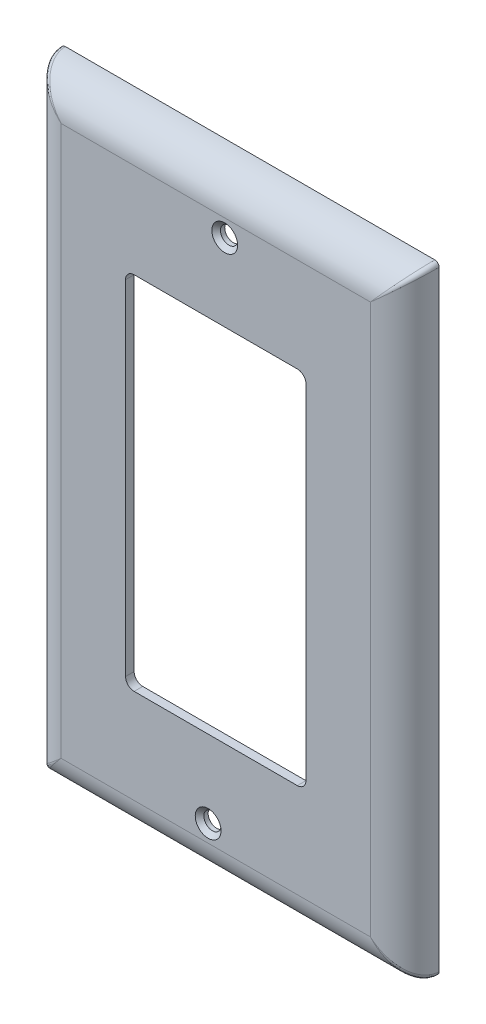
ISO-10303-21;
HEADER;
FILE_DESCRIPTION(('STEP AP214'),'2;1');
FILE_NAME('part.step','',(''),(''),'','','');
FILE_SCHEMA(('AUTOMOTIVE_DESIGN { 1 0 10303 214 1 1 1 1 }'));
ENDSEC;
DATA;
#1=APPLICATION_CONTEXT('core data for automotive mechanical design processes');
#2=APPLICATION_PROTOCOL_DEFINITION('international standard','automotive_design',2000,#1);
#3=PRODUCT_CONTEXT('',#1,'mechanical');
#4=PRODUCT('Part','Part','',(#3));
#5=PRODUCT_RELATED_PRODUCT_CATEGORY('part','',(#4));
#6=PRODUCT_DEFINITION_FORMATION('','',#4);
#7=PRODUCT_DEFINITION_CONTEXT('part definition',#1,'design');
#8=PRODUCT_DEFINITION('design','',#6,#7);
#9=PRODUCT_DEFINITION_SHAPE('','',#8);
#10=(LENGTH_UNIT() NAMED_UNIT(*) SI_UNIT(.MILLI.,.METRE.));
#11=(NAMED_UNIT(*) PLANE_ANGLE_UNIT() SI_UNIT($,.RADIAN.));
#12=(NAMED_UNIT(*) SI_UNIT($,.STERADIAN.) SOLID_ANGLE_UNIT());
#13=UNCERTAINTY_MEASURE_WITH_UNIT(LENGTH_MEASURE(1.E-05),#10,'distance_accuracy_value','');
#14=(GEOMETRIC_REPRESENTATION_CONTEXT(3) GLOBAL_UNCERTAINTY_ASSIGNED_CONTEXT((#13)) GLOBAL_UNIT_ASSIGNED_CONTEXT((#10,
#11,#12)) REPRESENTATION_CONTEXT('',''));
#15=CARTESIAN_POINT('',(0.,0.,0.));
#16=DIRECTION('',(0.,0.,1.));
#17=DIRECTION('',(1.,0.,0.));
#18=AXIS2_PLACEMENT_3D('',#15,#16,#17);
#19=CARTESIAN_POINT('',(34.13125,-56.35625,6.35));
#20=DIRECTION('',(0.,0.,-1.));
#21=DIRECTION('',(-1.,0.,0.));
#22=AXIS2_PLACEMENT_3D('',#19,#20,#21);
#23=PLANE('',#22);
#24=CARTESIAN_POINT('',(-1.40933667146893,-47.625,6.35));
#25=DIRECTION('',(0.,0.,-1.));
#26=DIRECTION('',(-1.,0.,0.));
#27=AXIS2_PLACEMENT_3D('',#24,#25,#26);
#28=CIRCLE('',#27,2.38125000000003);
#29=CARTESIAN_POINT('',(-3.79058667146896,-47.625,6.35));
#30=VERTEX_POINT('',#29);
#31=EDGE_CURVE('E10',#30,#30,#28,.T.);
#32=ORIENTED_EDGE('',*,*,#31,.T.);
#33=EDGE_LOOP('',(#32));
#34=FACE_BOUND('',#33,.T.);
#35=CARTESIAN_POINT('',(1.65993877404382,47.625,6.35));
#36=DIRECTION('',(0.,0.,-1.));
#37=DIRECTION('',(-1.,0.,0.));
#38=AXIS2_PLACEMENT_3D('',#35,#36,#37);
#39=CIRCLE('',#38,2.38125);
#40=CARTESIAN_POINT('',(-0.72131122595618,47.625,6.35));
#41=VERTEX_POINT('',#40);
#42=EDGE_CURVE('E491',#41,#41,#39,.T.);
#43=ORIENTED_EDGE('',*,*,#42,.T.);
#44=EDGE_LOOP('',(#43));
#45=FACE_BOUND('',#44,.T.);
#46=DIRECTION('',(1.,0.,0.));
#47=VECTOR('',#46,1.);
#48=CARTESIAN_POINT('',(-15.08125,-33.3375,6.35));
#49=LINE('',#48,#47);
#50=CARTESIAN_POINT('',(-15.08125,-33.3375,6.35));
#51=VERTEX_POINT('',#50);
#52=CARTESIAN_POINT('',(15.08125,-33.3375,6.35));
#53=VERTEX_POINT('',#52);
#54=EDGE_CURVE('E194',#51,#53,#49,.T.);
#55=ORIENTED_EDGE('',*,*,#54,.F.);
#56=CARTESIAN_POINT('',(-15.08125,-31.75,6.35));
#57=DIRECTION('',(0.,0.,1.));
#58=DIRECTION('',(-1.,0.,0.));
#59=AXIS2_PLACEMENT_3D('',#56,#57,#58);
#60=CIRCLE('',#59,1.5875);
#61=CARTESIAN_POINT('',(-16.66875,-31.75,6.35));
#62=VERTEX_POINT('',#61);
#63=EDGE_CURVE('E36',#62,#51,#60,.T.);
#64=ORIENTED_EDGE('',*,*,#63,.F.);
#65=DIRECTION('',(0.,-1.,0.));
#66=VECTOR('',#65,1.);
#67=CARTESIAN_POINT('',(-16.66875,31.75,6.35));
#68=LINE('',#67,#66);
#69=CARTESIAN_POINT('',(-16.66875,31.75,6.35));
#70=VERTEX_POINT('',#69);
#71=EDGE_CURVE('E223',#70,#62,#68,.T.);
#72=ORIENTED_EDGE('',*,*,#71,.F.);
#73=CARTESIAN_POINT('',(-15.08125,31.75,6.35));
#74=DIRECTION('',(0.,0.,1.));
#75=DIRECTION('',(-1.,0.,0.));
#76=AXIS2_PLACEMENT_3D('',#73,#74,#75);
#77=CIRCLE('',#76,1.5875);
#78=CARTESIAN_POINT('',(-15.08125,33.3375,6.35));
#79=VERTEX_POINT('',#78);
#80=EDGE_CURVE('E219',#79,#70,#77,.T.);
#81=ORIENTED_EDGE('',*,*,#80,.F.);
#82=DIRECTION('',(-1.,0.,0.));
#83=VECTOR('',#82,1.);
#84=CARTESIAN_POINT('',(-15.08125,33.3375,6.35));
#85=LINE('',#84,#83);
#86=CARTESIAN_POINT('',(15.08125,33.3375,6.35));
#87=VERTEX_POINT('',#86);
#88=EDGE_CURVE('E215',#87,#79,#85,.T.);
#89=ORIENTED_EDGE('',*,*,#88,.F.);
#90=CARTESIAN_POINT('',(15.08125,31.75,6.35));
#91=DIRECTION('',(0.,0.,1.));
#92=DIRECTION('',(1.,0.,0.));
#93=AXIS2_PLACEMENT_3D('',#90,#91,#92);
#94=CIRCLE('',#93,1.5875);
#95=CARTESIAN_POINT('',(16.66875,31.75,6.35));
#96=VERTEX_POINT('',#95);
#97=EDGE_CURVE('E208',#96,#87,#94,.T.);
#98=ORIENTED_EDGE('',*,*,#97,.F.);
#99=DIRECTION('',(0.,1.,0.));
#100=VECTOR('',#99,1.);
#101=CARTESIAN_POINT('',(16.66875,31.75,6.35));
#102=LINE('',#101,#100);
#103=CARTESIAN_POINT('',(16.66875,-31.75,6.35));
#104=VERTEX_POINT('',#103);
#105=EDGE_CURVE('E202',#104,#96,#102,.T.);
#106=ORIENTED_EDGE('',*,*,#105,.F.);
#107=CARTESIAN_POINT('',(15.08125,-31.75,6.35));
#108=DIRECTION('',(0.,0.,1.));
#109=DIRECTION('',(1.,0.,0.));
#110=AXIS2_PLACEMENT_3D('',#107,#108,#109);
#111=CIRCLE('',#110,1.5875);
#112=EDGE_CURVE('E184',#53,#104,#111,.T.);
#113=ORIENTED_EDGE('',*,*,#112,.F.);
#114=EDGE_LOOP('',(#55,#64,#72,#81,#89,#98,#106,#113));
#115=FACE_BOUND('',#114,.T.);
#116=DIRECTION('',(0.,-1.,0.));
#117=VECTOR('',#116,1.);
#118=CARTESIAN_POINT('',(-28.575,-56.35625,6.35));
#119=LINE('',#118,#117);
#120=CARTESIAN_POINT('',(-28.575,50.8,6.35));
#121=VERTEX_POINT('',#120);
#122=CARTESIAN_POINT('',(-28.575,-50.8,6.35));
#123=VERTEX_POINT('',#122);
#124=EDGE_CURVE('E324',#121,#123,#119,.T.);
#125=ORIENTED_EDGE('',*,*,#124,.T.);
#126=DIRECTION('',(1.,0.,0.));
#127=VECTOR('',#126,1.);
#128=CARTESIAN_POINT('',(34.13125,-50.8,6.35));
#129=LINE('',#128,#127);
#130=CARTESIAN_POINT('',(28.575,-50.8,6.35));
#131=VERTEX_POINT('',#130);
#132=EDGE_CURVE('E327',#123,#131,#129,.T.);
#133=ORIENTED_EDGE('',*,*,#132,.T.);
#134=DIRECTION('',(0.,-1.,0.));
#135=VECTOR('',#134,1.);
#136=CARTESIAN_POINT('',(28.575,56.35625,6.35));
#137=LINE('',#136,#135);
#138=CARTESIAN_POINT('',(28.575,50.8,6.35));
#139=VERTEX_POINT('',#138);
#140=EDGE_CURVE('E318',#131,#139,#137,.F.);
#141=ORIENTED_EDGE('',*,*,#140,.T.);
#142=DIRECTION('',(1.,0.,0.));
#143=VECTOR('',#142,1.);
#144=CARTESIAN_POINT('',(-34.13125,50.8,6.35));
#145=LINE('',#144,#143);
#146=EDGE_CURVE('E321',#139,#121,#145,.F.);
#147=ORIENTED_EDGE('',*,*,#146,.T.);
#148=EDGE_LOOP('',(#125,#133,#141,#147));
#149=FACE_BOUND('',#148,.T.);
#150=ADVANCED_FACE('F15',(#34,#45,#115,#149),#23,.F.);
#151=CARTESIAN_POINT('',(34.13125,-56.35625,0.));
#152=DIRECTION('',(0.,0.,-1.));
#153=DIRECTION('',(-1.,0.,0.));
#154=AXIS2_PLACEMENT_3D('',#151,#152,#153);
#155=PLANE('',#154);
#156=DIRECTION('',(0.,1.,0.));
#157=VECTOR('',#156,1.);
#158=CARTESIAN_POINT('',(33.3375,55.5625,0.));
#159=LINE('',#158,#157);
#160=CARTESIAN_POINT('',(33.3375,55.5625,0.));
#161=VERTEX_POINT('',#160);
#162=CARTESIAN_POINT('',(33.3375,-55.5625,0.));
#163=VERTEX_POINT('',#162);
#164=EDGE_CURVE('E259',#161,#163,#159,.F.);
#165=ORIENTED_EDGE('',*,*,#164,.F.);
#166=DIRECTION('',(-1.,0.,0.));
#167=VECTOR('',#166,1.);
#168=CARTESIAN_POINT('',(-33.3375,55.5625,0.));
#169=LINE('',#168,#167);
#170=CARTESIAN_POINT('',(-33.3375,55.5625,0.));
#171=VERTEX_POINT('',#170);
#172=EDGE_CURVE('E277',#171,#161,#169,.F.);
#173=ORIENTED_EDGE('',*,*,#172,.F.);
#174=DIRECTION('',(0.,-1.,0.));
#175=VECTOR('',#174,1.);
#176=CARTESIAN_POINT('',(-33.3375,55.5625,0.));
#177=LINE('',#176,#175);
#178=CARTESIAN_POINT('',(-33.3375,-55.5625,0.));
#179=VERTEX_POINT('',#178);
#180=EDGE_CURVE('E281',#171,#179,#177,.T.);
#181=ORIENTED_EDGE('',*,*,#180,.T.);
#182=DIRECTION('',(1.,0.,0.));
#183=VECTOR('',#182,1.);
#184=CARTESIAN_POINT('',(-33.3375,-55.5625,0.));
#185=LINE('',#184,#183);
#186=EDGE_CURVE('E266',#179,#163,#185,.T.);
#187=ORIENTED_EDGE('',*,*,#186,.T.);
#188=EDGE_LOOP('',(#165,#173,#181,#187));
#189=FACE_BOUND('',#188,.T.);
#190=CARTESIAN_POINT('',(34.13125,-56.35625,0.));
#191=DIRECTION('',(0.,0.,-1.));
#192=DIRECTION('',(-1.,0.,0.));
#193=AXIS2_PLACEMENT_3D('',#190,#191,#192);
#194=CIRCLE('',#193,0.79375);
#195=CARTESIAN_POINT('',(34.925,-56.35625,0.));
#196=VERTEX_POINT('',#195);
#197=CARTESIAN_POINT('',(34.13125,-57.15,0.));
#198=VERTEX_POINT('',#197);
#199=EDGE_CURVE('E290',#196,#198,#194,.T.);
#200=ORIENTED_EDGE('',*,*,#199,.T.);
#201=DIRECTION('',(1.,0.,0.));
#202=VECTOR('',#201,1.);
#203=CARTESIAN_POINT('',(-34.13125,-57.15,0.));
#204=LINE('',#203,#202);
#205=CARTESIAN_POINT('',(-34.13125,-57.15,0.));
#206=VERTEX_POINT('',#205);
#207=EDGE_CURVE('E293',#206,#198,#204,.T.);
#208=ORIENTED_EDGE('',*,*,#207,.F.);
#209=CARTESIAN_POINT('',(-34.13125,-56.35625,0.));
#210=DIRECTION('',(0.,0.,-1.));
#211=DIRECTION('',(-1.,0.,0.));
#212=AXIS2_PLACEMENT_3D('',#209,#210,#211);
#213=CIRCLE('',#212,0.79375);
#214=CARTESIAN_POINT('',(-34.925,-56.35625,0.));
#215=VERTEX_POINT('',#214);
#216=EDGE_CURVE('E298',#206,#215,#213,.T.);
#217=ORIENTED_EDGE('',*,*,#216,.T.);
#218=DIRECTION('',(0.,-1.,0.));
#219=VECTOR('',#218,1.);
#220=CARTESIAN_POINT('',(-34.925,56.35625,0.));
#221=LINE('',#220,#219);
#222=CARTESIAN_POINT('',(-34.925,56.35625,0.));
#223=VERTEX_POINT('',#222);
#224=EDGE_CURVE('E301',#223,#215,#221,.T.);
#225=ORIENTED_EDGE('',*,*,#224,.F.);
#226=CARTESIAN_POINT('',(-34.13125,56.35625,0.));
#227=DIRECTION('',(0.,0.,-1.));
#228=DIRECTION('',(-1.,0.,0.));
#229=AXIS2_PLACEMENT_3D('',#226,#227,#228);
#230=CIRCLE('',#229,0.79375);
#231=CARTESIAN_POINT('',(-34.13125,57.15,0.));
#232=VERTEX_POINT('',#231);
#233=EDGE_CURVE('E305',#223,#232,#230,.T.);
#234=ORIENTED_EDGE('',*,*,#233,.T.);
#235=DIRECTION('',(1.,0.,0.));
#236=VECTOR('',#235,1.);
#237=CARTESIAN_POINT('',(-34.13125,57.15,0.));
#238=LINE('',#237,#236);
#239=CARTESIAN_POINT('',(34.13125,57.15,0.));
#240=VERTEX_POINT('',#239);
#241=EDGE_CURVE('E308',#232,#240,#238,.T.);
#242=ORIENTED_EDGE('',*,*,#241,.T.);
#243=CARTESIAN_POINT('',(34.13125,56.35625,0.));
#244=DIRECTION('',(0.,0.,1.));
#245=DIRECTION('',(1.,0.,0.));
#246=AXIS2_PLACEMENT_3D('',#243,#244,#245);
#247=CIRCLE('',#246,0.79375);
#248=CARTESIAN_POINT('',(34.925,56.35625,0.));
#249=VERTEX_POINT('',#248);
#250=EDGE_CURVE('E311',#249,#240,#247,.T.);
#251=ORIENTED_EDGE('',*,*,#250,.F.);
#252=DIRECTION('',(0.,-1.,0.));
#253=VECTOR('',#252,1.);
#254=CARTESIAN_POINT('',(34.925,56.35625,0.));
#255=LINE('',#254,#253);
#256=EDGE_CURVE('E315',#249,#196,#255,.T.);
#257=ORIENTED_EDGE('',*,*,#256,.T.);
#258=EDGE_LOOP('',(#200,#208,#217,#225,#234,#242,#251,#257));
#259=FACE_BOUND('',#258,.T.);
#260=ADVANCED_FACE('F411',(#189,#259),#155,.T.);
#261=CARTESIAN_POINT('',(-34.13125,50.8,0.));
#262=DIRECTION('',(-1.,0.,0.));
#263=DIRECTION('',(0.,0.,1.));
#264=AXIS2_PLACEMENT_3D('',#261,#262,#263);
#265=CYLINDRICAL_SURFACE('',#264,6.35);
#266=CARTESIAN_POINT('',(28.575,50.8,0.));
#267=DIRECTION('',(0.752576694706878,-0.658504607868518,0.));
#268=DIRECTION('',(-0.658504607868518,-0.752576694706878,0.));
#269=AXIS2_PLACEMENT_3D('',#266,#267,#268);
#270=ELLIPSE('',#269,8.43767823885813,6.35);
#271=EDGE_CURVE('E383',#240,#139,#270,.T.);
#272=ORIENTED_EDGE('',*,*,#271,.F.);
#273=ORIENTED_EDGE('',*,*,#241,.F.);
#274=CARTESIAN_POINT('',(-28.575,50.8,0.));
#275=DIRECTION('',(0.752576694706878,0.658504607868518,0.));
#276=DIRECTION('',(0.658504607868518,-0.752576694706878,0.));
#277=AXIS2_PLACEMENT_3D('',#274,#275,#276);
#278=ELLIPSE('',#277,8.43767823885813,6.35);
#279=EDGE_CURVE('E294',#121,#232,#278,.F.);
#280=ORIENTED_EDGE('',*,*,#279,.F.);
#281=ORIENTED_EDGE('',*,*,#146,.F.);
#282=EDGE_LOOP('',(#272,#273,#280,#281));
#283=FACE_BOUND('',#282,.T.);
#284=ADVANCED_FACE('F377',(#283),#265,.T.);
#285=CARTESIAN_POINT('',(-28.575,50.8,6.35));
#286=CARTESIAN_POINT('',(-28.575,50.8,6.35000000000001));
#287=CARTESIAN_POINT('',(-28.575,50.8,6.35));
#288=CARTESIAN_POINT('',(-28.8170566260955,51.0766361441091,6.3498886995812));
#289=CARTESIAN_POINT('',(-28.8343968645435,51.0593968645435,6.35014871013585));
#290=CARTESIAN_POINT('',(-28.8516361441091,51.0420566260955,6.3498886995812));
#291=CARTESIAN_POINT('',(-29.0591750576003,51.3533429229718,6.3319136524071));
#292=CARTESIAN_POINT('',(-29.0945096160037,51.3195096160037,6.3341594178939));
#293=CARTESIAN_POINT('',(-29.1283429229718,51.2841750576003,6.3319136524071));
#294=CARTESIAN_POINT('',(-29.5392482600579,51.9019980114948,6.25974411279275));
#295=CARTESIAN_POINT('',(-29.6097248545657,51.8347248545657,6.27080316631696));
#296=CARTESIAN_POINT('',(-29.6769980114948,51.7642482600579,6.25974411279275));
#297=CARTESIAN_POINT('',(-29.7772209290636,52.1739667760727,6.20585878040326));
#298=CARTESIAN_POINT('',(-29.8662987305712,52.0912987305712,6.22334619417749));
#299=CARTESIAN_POINT('',(-29.9489667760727,52.0022209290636,6.20585878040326));
#300=CARTESIAN_POINT('',(-30.2449499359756,52.7085142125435,6.06261072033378));
#301=CARTESIAN_POINT('',(-30.3709604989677,52.5959604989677,6.09740647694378));
#302=CARTESIAN_POINT('',(-30.4835142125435,52.4699499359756,6.06261072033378));
#303=CARTESIAN_POINT('',(-30.4747771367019,52.9711738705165,5.97385821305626));
#304=CARTESIAN_POINT('',(-30.6205011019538,52.8455011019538,6.01874749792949));
#305=CARTESIAN_POINT('',(-30.7461738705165,52.6997771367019,5.97385821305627));
#306=CARTESIAN_POINT('',(-30.9222126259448,53.4825287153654,5.7620532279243));
#307=CARTESIAN_POINT('',(-31.1077961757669,53.3327961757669,5.83118124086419));
#308=CARTESIAN_POINT('',(-31.2575287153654,53.1472126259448,5.76205322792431));
#309=CARTESIAN_POINT('',(-31.139982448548,53.7314085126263,5.63989956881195));
#310=CARTESIAN_POINT('',(-31.3469541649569,53.5719541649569,5.72202105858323));
#311=CARTESIAN_POINT('',(-31.5064085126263,53.364982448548,5.63989956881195));
#312=CARTESIAN_POINT('',(-31.5594832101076,54.2108379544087,5.36309958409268));
#313=CARTESIAN_POINT('',(-31.8103698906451,54.0353698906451,5.47423907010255));
#314=CARTESIAN_POINT('',(-31.9858379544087,53.7844832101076,5.36309958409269));
#315=CARTESIAN_POINT('',(-31.7615040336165,54.4417188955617,5.20961126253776));
#316=CARTESIAN_POINT('',(-32.0359409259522,54.2609409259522,5.33531466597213));
#317=CARTESIAN_POINT('',(-32.2167188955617,53.9865040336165,5.20961126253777));
#318=CARTESIAN_POINT('',(-32.1459134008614,54.8810438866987,4.87250411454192));
#319=CARTESIAN_POINT('',(-32.4692316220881,54.6942316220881,5.02869595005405));
#320=CARTESIAN_POINT('',(-32.6560438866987,54.3709134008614,4.87250411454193));
#321=CARTESIAN_POINT('',(-32.3287562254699,55.0900071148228,4.69025161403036));
#322=CARTESIAN_POINT('',(-32.6781124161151,54.9031124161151,4.86070740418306));
#323=CARTESIAN_POINT('',(-32.8650071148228,54.5537562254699,4.69025161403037));
#324=CARTESIAN_POINT('',(-32.6715080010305,55.4817234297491,4.29853019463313));
#325=CARTESIAN_POINT('',(-33.0750957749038,55.3000957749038,4.49636065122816));
#326=CARTESIAN_POINT('',(-33.2567234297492,54.8965080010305,4.29853019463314));
#327=CARTESIAN_POINT('',(-32.8320621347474,55.6652138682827,4.0905515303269));
#328=CARTESIAN_POINT('',(-33.2641286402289,55.4891286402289,4.29982545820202));
#329=CARTESIAN_POINT('',(-33.4402138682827,55.0570621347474,4.09055153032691));
#330=CARTESIAN_POINT('',(-33.1272893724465,56.0026164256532,3.65082817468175));
#331=CARTESIAN_POINT('',(-33.6182214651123,55.8432214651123,3.8784547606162));
#332=CARTESIAN_POINT('',(-33.7776164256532,55.3522893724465,3.65082817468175));
#333=CARTESIAN_POINT('',(-33.2628014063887,56.1574873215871,3.42057190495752));
#334=CARTESIAN_POINT('',(-33.7838990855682,56.0088990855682,3.65373763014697));
#335=CARTESIAN_POINT('',(-33.9324873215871,55.4878014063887,3.42057190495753));
#336=CARTESIAN_POINT('',(-33.5054272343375,56.4347739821,2.94027356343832));
#337=CARTESIAN_POINT('',(-34.0873958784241,56.3123958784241,3.17607652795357));
#338=CARTESIAN_POINT('',(-34.2097739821,55.7304272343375,2.94027356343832));
#339=CARTESIAN_POINT('',(-33.6135308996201,56.5583210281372,2.69155442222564));
#340=CARTESIAN_POINT('',(-34.2254674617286,56.4504674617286,2.92379476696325));
#341=CARTESIAN_POINT('',(-34.3333210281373,55.8385308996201,2.69155442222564));
#342=CARTESIAN_POINT('',(-33.7993488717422,56.7706844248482,2.17882169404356));
#343=CARTESIAN_POINT('',(-34.4688427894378,56.6938427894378,2.39210469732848));
#344=CARTESIAN_POINT('',(-34.5456844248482,56.0243488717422,2.17882169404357));
#345=CARTESIAN_POINT('',(-33.8780921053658,56.8606766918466,1.91579585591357));
#346=CARTESIAN_POINT('',(-34.5740598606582,56.7990598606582,2.11417290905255));
#347=CARTESIAN_POINT('',(-34.6356766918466,56.1030921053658,1.91579585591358));
#348=CARTESIAN_POINT('',(-34.0038419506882,57.0043908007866,1.37938207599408));
#349=CARTESIAN_POINT('',(-34.7460677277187,56.9710677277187,1.53501051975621));
#350=CARTESIAN_POINT('',(-34.7793908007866,56.2288419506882,1.37938207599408));
#351=CARTESIAN_POINT('',(-34.0517305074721,57.0591205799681,1.10654241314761));
#352=CARTESIAN_POINT('',(-34.8125784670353,57.0375784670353,1.23623243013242));
#353=CARTESIAN_POINT('',(-34.8341205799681,56.2767305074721,1.10654241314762));
#354=CARTESIAN_POINT('',(-34.115175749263,57.1316294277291,0.55569635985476));
#355=CARTESIAN_POINT('',(-34.9021628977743,57.1271628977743,0.623377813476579));
#356=CARTESIAN_POINT('',(-34.9066294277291,56.340175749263,0.555696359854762));
#357=CARTESIAN_POINT('',(-34.13125,57.15,0.27784817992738));
#358=CARTESIAN_POINT('',(-34.925,57.15,0.312598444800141));
#359=CARTESIAN_POINT('',(-34.925,56.35625,0.277848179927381));
#360=CARTESIAN_POINT('',(-34.13125,57.15,-0.277848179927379));
#361=CARTESIAN_POINT('',(-34.925,57.15,-0.31259844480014));
#362=CARTESIAN_POINT('',(-34.925,56.35625,-0.27784817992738));
#363=CARTESIAN_POINT('',(-34.115175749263,57.1316294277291,-0.555696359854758));
#364=CARTESIAN_POINT('',(-34.9021628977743,57.1271628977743,-0.623377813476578));
#365=CARTESIAN_POINT('',(-34.9066294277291,56.340175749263,-0.55569635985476));
#366=CARTESIAN_POINT('',(-34.0517305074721,57.0591205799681,-1.10654241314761));
#367=CARTESIAN_POINT('',(-34.8125784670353,57.0375784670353,-1.23623243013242));
#368=CARTESIAN_POINT('',(-34.8341205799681,56.2767305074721,-1.10654241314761));
#369=CARTESIAN_POINT('',(-34.0038419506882,57.0043908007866,-1.37938207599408));
#370=CARTESIAN_POINT('',(-34.7460677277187,56.9710677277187,-1.53501051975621));
#371=CARTESIAN_POINT('',(-34.7793908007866,56.2288419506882,-1.37938207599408));
#372=CARTESIAN_POINT('',(-33.8780921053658,56.8606766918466,-1.91579585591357));
#373=CARTESIAN_POINT('',(-34.5740598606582,56.7990598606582,-2.11417290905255));
#374=CARTESIAN_POINT('',(-34.6356766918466,56.1030921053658,-1.91579585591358));
#375=CARTESIAN_POINT('',(-33.7993488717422,56.7706844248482,-2.17882169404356));
#376=CARTESIAN_POINT('',(-34.4688427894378,56.6938427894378,-2.39210469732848));
#377=CARTESIAN_POINT('',(-34.5456844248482,56.0243488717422,-2.17882169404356));
#378=CARTESIAN_POINT('',(-33.6135308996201,56.5583210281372,-2.69155442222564));
#379=CARTESIAN_POINT('',(-34.2254674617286,56.4504674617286,-2.92379476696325));
#380=CARTESIAN_POINT('',(-34.3333210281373,55.8385308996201,-2.69155442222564));
#381=CARTESIAN_POINT('',(-33.5054272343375,56.4347739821,-2.94027356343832));
#382=CARTESIAN_POINT('',(-34.0873958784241,56.3123958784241,-3.17607652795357));
#383=CARTESIAN_POINT('',(-34.2097739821,55.7304272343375,-2.94027356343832));
#384=CARTESIAN_POINT('',(-33.2628014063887,56.1574873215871,-3.42057190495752));
#385=CARTESIAN_POINT('',(-33.7838990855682,56.0088990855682,-3.65373763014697));
#386=CARTESIAN_POINT('',(-33.9324873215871,55.4878014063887,-3.42057190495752));
#387=CARTESIAN_POINT('',(-33.1272893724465,56.0026164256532,-3.65082817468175));
#388=CARTESIAN_POINT('',(-33.6182214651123,55.8432214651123,-3.87845476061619));
#389=CARTESIAN_POINT('',(-33.7776164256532,55.3522893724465,-3.65082817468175));
#390=CARTESIAN_POINT('',(-32.8320621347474,55.6652138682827,-4.0905515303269));
#391=CARTESIAN_POINT('',(-33.2641286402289,55.4891286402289,-4.29982545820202));
#392=CARTESIAN_POINT('',(-33.4402138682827,55.0570621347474,-4.0905515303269));
#393=CARTESIAN_POINT('',(-32.6715080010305,55.4817234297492,-4.29853019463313));
#394=CARTESIAN_POINT('',(-33.0750957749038,55.3000957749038,-4.49636065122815));
#395=CARTESIAN_POINT('',(-33.2567234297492,54.8965080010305,-4.29853019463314));
#396=CARTESIAN_POINT('',(-32.3287562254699,55.0900071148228,-4.69025161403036));
#397=CARTESIAN_POINT('',(-32.6781124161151,54.9031124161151,-4.86070740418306));
#398=CARTESIAN_POINT('',(-32.8650071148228,54.5537562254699,-4.69025161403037));
#399=CARTESIAN_POINT('',(-32.1459134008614,54.8810438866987,-4.87250411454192));
#400=CARTESIAN_POINT('',(-32.4692316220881,54.6942316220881,-5.02869595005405));
#401=CARTESIAN_POINT('',(-32.6560438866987,54.3709134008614,-4.87250411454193));
#402=CARTESIAN_POINT('',(-31.7615040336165,54.4417188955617,-5.20961126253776));
#403=CARTESIAN_POINT('',(-32.0359409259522,54.2609409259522,-5.33531466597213));
#404=CARTESIAN_POINT('',(-32.2167188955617,53.9865040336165,-5.20961126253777));
#405=CARTESIAN_POINT('',(-31.5594832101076,54.2108379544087,-5.36309958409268));
#406=CARTESIAN_POINT('',(-31.8103698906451,54.0353698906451,-5.47423907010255));
#407=CARTESIAN_POINT('',(-31.9858379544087,53.7844832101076,-5.36309958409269));
#408=CARTESIAN_POINT('',(-31.139982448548,53.7314085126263,-5.63989956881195));
#409=CARTESIAN_POINT('',(-31.3469541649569,53.5719541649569,-5.72202105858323));
#410=CARTESIAN_POINT('',(-31.5064085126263,53.364982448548,-5.63989956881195));
#411=CARTESIAN_POINT('',(-30.9222126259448,53.4825287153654,-5.7620532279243));
#412=CARTESIAN_POINT('',(-31.1077961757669,53.3327961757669,-5.83118124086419));
#413=CARTESIAN_POINT('',(-31.2575287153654,53.1472126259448,-5.76205322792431));
#414=CARTESIAN_POINT('',(-30.4747771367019,52.9711738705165,-5.97385821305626));
#415=CARTESIAN_POINT('',(-30.6205011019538,52.8455011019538,-6.01874749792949));
#416=CARTESIAN_POINT('',(-30.7461738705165,52.6997771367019,-5.97385821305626));
#417=CARTESIAN_POINT('',(-30.2449499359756,52.7085142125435,-6.06261072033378));
#418=CARTESIAN_POINT('',(-30.3709604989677,52.5959604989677,-6.09740647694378));
#419=CARTESIAN_POINT('',(-30.4835142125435,52.4699499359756,-6.06261072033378));
#420=CARTESIAN_POINT('',(-29.7772209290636,52.1739667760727,-6.20585878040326));
#421=CARTESIAN_POINT('',(-29.8662987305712,52.0912987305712,-6.22334619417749));
#422=CARTESIAN_POINT('',(-29.9489667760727,52.0022209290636,-6.20585878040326));
#423=CARTESIAN_POINT('',(-29.5392482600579,51.9019980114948,-6.25974411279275));
#424=CARTESIAN_POINT('',(-29.6097248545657,51.8347248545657,-6.27080316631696));
#425=CARTESIAN_POINT('',(-29.6769980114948,51.7642482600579,-6.25974411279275));
#426=CARTESIAN_POINT('',(-29.0591750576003,51.3533429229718,-6.3319136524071));
#427=CARTESIAN_POINT('',(-29.0945096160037,51.3195096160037,-6.33415941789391));
#428=CARTESIAN_POINT('',(-29.1283429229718,51.2841750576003,-6.3319136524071));
#429=CARTESIAN_POINT('',(-28.8170566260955,51.0766361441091,-6.3498886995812));
#430=CARTESIAN_POINT('',(-28.8343968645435,51.0593968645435,-6.35014871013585));
#431=CARTESIAN_POINT('',(-28.8516361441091,51.0420566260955,-6.3498886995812));
#432=CARTESIAN_POINT('',(-28.575,50.8,-6.35));
#433=CARTESIAN_POINT('',(-28.575,50.8,-6.35000000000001));
#434=CARTESIAN_POINT('',(-28.575,50.8,-6.35));
#435=(BOUNDED_SURFACE() B_SPLINE_SURFACE(3,2,((#285,#286,#287),(#288,#289,#290),(#291,#292,
#293),(#294,#295,#296),(#297,#298,#299),(#300,#301,#302),(#303,#304,#305),(#306,#307,#308),
(#309,#310,#311),(#312,#313,#314),(#315,#316,#317),(#318,#319,#320),(#321,#322,#323),(#324,#325,
#326),(#327,#328,#329),(#330,#331,#332),(#333,#334,#335),(#336,#337,#338),(#339,#340,#341),
(#342,#343,#344),(#345,#346,#347),(#348,#349,#350),(#351,#352,#353),(#354,#355,#356),(#357,#358,
#359),(#360,#361,#362),(#363,#364,#365),(#366,#367,#368),(#369,#370,#371),(#372,#373,#374),
(#375,#376,#377),(#378,#379,#380),(#381,#382,#383),(#384,#385,#386),(#387,#388,#389),(#390,#391,
#392),(#393,#394,#395),(#396,#397,#398),(#399,#400,#401),(#402,#403,#404),(#405,#406,#407),
(#408,#409,#410),(#411,#412,#413),(#414,#415,#416),(#417,#418,#419),(#420,#421,#422),(#423,#424,
#425),(#426,#427,#428),(#429,#430,#431),(#432,#433,#434)),.UNSPECIFIED.,.F.,.F.,
.F.) B_SPLINE_SURFACE_WITH_KNOTS((4,2,2,2,2,2,2,2,2,2,2,2,2,2,2,2,2,2,2,2,2,2,2,2,4),(3,3),(0.,
1.02673973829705,2.04475229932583,3.04568978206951,4.02196977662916,4.96717471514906,
5.8764679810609,6.74702342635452,7.57844910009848,8.37315558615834,9.13657236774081,
9.87706642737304,10.6054114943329,11.3337565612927,12.0742506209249,12.8376674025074,
13.6323738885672,14.4637995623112,15.3343550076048,16.2436482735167,17.1888532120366,
18.1651332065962,19.1660706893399,20.1840832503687,21.2108229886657),(0.,1.),
.UNSPECIFIED.) GEOMETRIC_REPRESENTATION_ITEM() RATIONAL_B_SPLINE_SURFACE(((1.,1.,1.),(1.,
1.00000566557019,1.),(1.,0.998576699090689,1.),(1.,0.992910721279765,1.),(1.,0.988697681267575,
1.),(1.,0.97761712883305,1.),(1.,0.970795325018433,1.),(1.,0.954789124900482,1.),(1.,
0.945667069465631,1.),(1.,0.925487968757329,1.),(1.,0.914501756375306,1.),(1.,0.891169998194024,
1.),(1.,0.878891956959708,1.),(1.,0.853706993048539,1.),(1.,0.840849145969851,1.),(1.,
0.815387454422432,1.),(1.,0.802798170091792,1.),(1.,0.77888073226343,1.),(1.,0.767521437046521,
1.),(1.,0.747118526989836,1.),(1.,0.738001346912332,1.),(1.,0.723039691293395,1.),(1.,
0.717105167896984,1.),(1.,0.709170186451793,1.),(1.,0.707106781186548,1.),(1.,0.707106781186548,
1.),(1.,0.709170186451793,1.),(1.,0.717105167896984,1.),(1.,0.723039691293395,1.),(1.,
0.738001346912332,1.),(1.,0.747118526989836,1.),(1.,0.767521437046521,1.),(1.,0.778880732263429,
1.),(1.,0.802798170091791,1.),(1.,0.81538745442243,1.),(1.,0.84084914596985,1.),(1.,
0.853706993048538,1.),(1.,0.878891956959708,1.),(1.,0.891169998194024,1.),(1.,0.914501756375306,
1.),(1.,0.92548796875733,1.),(1.,0.945667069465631,1.),(1.,0.954789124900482,1.),(1.,
0.970795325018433,1.),(1.,0.97761712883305,1.),(1.,0.988697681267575,1.),(1.,0.992910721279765,
1.),(1.,0.998576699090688,1.),(1.,1.00000566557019,1.),(1.,1.,1.))) REPRESENTATION_ITEM('') SURFACE());
#436=ORIENTED_EDGE('',*,*,#279,.T.);
#437=ORIENTED_EDGE('',*,*,#233,.F.);
#438=CARTESIAN_POINT('',(-28.575,50.8,0.));
#439=DIRECTION('',(0.658504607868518,0.752576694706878,0.));
#440=DIRECTION('',(0.752576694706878,-0.658504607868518,0.));
#441=AXIS2_PLACEMENT_3D('',#438,#439,#440);
#442=ELLIPSE('',#441,8.43767823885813,6.35);
#443=EDGE_CURVE('E592',#121,#223,#442,.F.);
#444=ORIENTED_EDGE('',*,*,#443,.F.);
#445=EDGE_LOOP('',(#436,#437,#444));
#446=FACE_BOUND('',#445,.T.);
#447=ADVANCED_FACE('F374',(#446),#435,.T.);
#448=CARTESIAN_POINT('',(28.575,50.8,6.35));
#449=CARTESIAN_POINT('',(28.575,50.8,6.35000000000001));
#450=CARTESIAN_POINT('',(28.575,50.8,6.35));
#451=CARTESIAN_POINT('',(28.8516361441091,51.0420566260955,6.3498886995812));
#452=CARTESIAN_POINT('',(28.8343968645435,51.0593968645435,6.35014871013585));
#453=CARTESIAN_POINT('',(28.8170566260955,51.0766361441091,6.3498886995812));
#454=CARTESIAN_POINT('',(29.1283429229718,51.2841750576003,6.3319136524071));
#455=CARTESIAN_POINT('',(29.0945096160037,51.3195096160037,6.33415941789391));
#456=CARTESIAN_POINT('',(29.0591750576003,51.3533429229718,6.3319136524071));
#457=CARTESIAN_POINT('',(29.6769980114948,51.7642482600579,6.25974411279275));
#458=CARTESIAN_POINT('',(29.6097248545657,51.8347248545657,6.27080316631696));
#459=CARTESIAN_POINT('',(29.5392482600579,51.9019980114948,6.25974411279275));
#460=CARTESIAN_POINT('',(29.9489667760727,52.0022209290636,6.20585878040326));
#461=CARTESIAN_POINT('',(29.8662987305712,52.0912987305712,6.22334619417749));
#462=CARTESIAN_POINT('',(29.7772209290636,52.1739667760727,6.20585878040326));
#463=CARTESIAN_POINT('',(30.4835142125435,52.4699499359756,6.06261072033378));
#464=CARTESIAN_POINT('',(30.3709604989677,52.5959604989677,6.09740647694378));
#465=CARTESIAN_POINT('',(30.2449499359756,52.7085142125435,6.06261072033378));
#466=CARTESIAN_POINT('',(30.7461738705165,52.6997771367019,5.97385821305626));
#467=CARTESIAN_POINT('',(30.6205011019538,52.8455011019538,6.01874749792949));
#468=CARTESIAN_POINT('',(30.4747771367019,52.9711738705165,5.97385821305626));
#469=CARTESIAN_POINT('',(31.2575287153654,53.1472126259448,5.7620532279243));
#470=CARTESIAN_POINT('',(31.1077961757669,53.3327961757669,5.83118124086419));
#471=CARTESIAN_POINT('',(30.9222126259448,53.4825287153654,5.7620532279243));
#472=CARTESIAN_POINT('',(31.5064085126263,53.364982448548,5.63989956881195));
#473=CARTESIAN_POINT('',(31.3469541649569,53.5719541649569,5.72202105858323));
#474=CARTESIAN_POINT('',(31.139982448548,53.7314085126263,5.63989956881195));
#475=CARTESIAN_POINT('',(31.9858379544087,53.7844832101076,5.36309958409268));
#476=CARTESIAN_POINT('',(31.8103698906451,54.0353698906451,5.47423907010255));
#477=CARTESIAN_POINT('',(31.5594832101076,54.2108379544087,5.36309958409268));
#478=CARTESIAN_POINT('',(32.2167188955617,53.9865040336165,5.20961126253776));
#479=CARTESIAN_POINT('',(32.0359409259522,54.2609409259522,5.33531466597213));
#480=CARTESIAN_POINT('',(31.7615040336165,54.4417188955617,5.20961126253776));
#481=CARTESIAN_POINT('',(32.6560438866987,54.3709134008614,4.87250411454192));
#482=CARTESIAN_POINT('',(32.4692316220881,54.6942316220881,5.02869595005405));
#483=CARTESIAN_POINT('',(32.1459134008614,54.8810438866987,4.87250411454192));
#484=CARTESIAN_POINT('',(32.8650071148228,54.5537562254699,4.69025161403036));
#485=CARTESIAN_POINT('',(32.6781124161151,54.9031124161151,4.86070740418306));
#486=CARTESIAN_POINT('',(32.3287562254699,55.0900071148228,4.69025161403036));
#487=CARTESIAN_POINT('',(33.2567234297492,54.8965080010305,4.29853019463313));
#488=CARTESIAN_POINT('',(33.0750957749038,55.3000957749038,4.49636065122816));
#489=CARTESIAN_POINT('',(32.6715080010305,55.4817234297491,4.29853019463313));
#490=CARTESIAN_POINT('',(33.4402138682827,55.0570621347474,4.0905515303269));
#491=CARTESIAN_POINT('',(33.2641286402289,55.4891286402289,4.29982545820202));
#492=CARTESIAN_POINT('',(32.8320621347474,55.6652138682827,4.0905515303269));
#493=CARTESIAN_POINT('',(33.7776164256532,55.3522893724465,3.65082817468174));
#494=CARTESIAN_POINT('',(33.6182214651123,55.8432214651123,3.8784547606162));
#495=CARTESIAN_POINT('',(33.1272893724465,56.0026164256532,3.65082817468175));
#496=CARTESIAN_POINT('',(33.9324873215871,55.4878014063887,3.42057190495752));
#497=CARTESIAN_POINT('',(33.7838990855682,56.0088990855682,3.65373763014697));
#498=CARTESIAN_POINT('',(33.2628014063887,56.1574873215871,3.42057190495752));
#499=CARTESIAN_POINT('',(34.2097739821,55.7304272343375,2.94027356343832));
#500=CARTESIAN_POINT('',(34.0873958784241,56.3123958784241,3.17607652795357));
#501=CARTESIAN_POINT('',(33.5054272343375,56.4347739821,2.94027356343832));
#502=CARTESIAN_POINT('',(34.3333210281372,55.8385308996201,2.69155442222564));
#503=CARTESIAN_POINT('',(34.2254674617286,56.4504674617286,2.92379476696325));
#504=CARTESIAN_POINT('',(33.6135308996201,56.5583210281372,2.69155442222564));
#505=CARTESIAN_POINT('',(34.5456844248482,56.0243488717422,2.17882169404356));
#506=CARTESIAN_POINT('',(34.4688427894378,56.6938427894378,2.39210469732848));
#507=CARTESIAN_POINT('',(33.7993488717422,56.7706844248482,2.17882169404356));
#508=CARTESIAN_POINT('',(34.6356766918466,56.1030921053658,1.91579585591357));
#509=CARTESIAN_POINT('',(34.5740598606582,56.7990598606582,2.11417290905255));
#510=CARTESIAN_POINT('',(33.8780921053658,56.8606766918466,1.91579585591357));
#511=CARTESIAN_POINT('',(34.7793908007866,56.2288419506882,1.37938207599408));
#512=CARTESIAN_POINT('',(34.7460677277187,56.9710677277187,1.53501051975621));
#513=CARTESIAN_POINT('',(34.0038419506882,57.0043908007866,1.37938207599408));
#514=CARTESIAN_POINT('',(34.8341205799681,56.2767305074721,1.10654241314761));
#515=CARTESIAN_POINT('',(34.8125784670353,57.0375784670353,1.23623243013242));
#516=CARTESIAN_POINT('',(34.0517305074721,57.0591205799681,1.10654241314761));
#517=CARTESIAN_POINT('',(34.9066294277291,56.340175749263,0.55569635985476));
#518=CARTESIAN_POINT('',(34.9021628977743,57.1271628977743,0.623377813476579));
#519=CARTESIAN_POINT('',(34.115175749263,57.1316294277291,0.55569635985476));
#520=CARTESIAN_POINT('',(34.925,56.35625,0.27784817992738));
#521=CARTESIAN_POINT('',(34.925,57.15,0.312598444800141));
#522=CARTESIAN_POINT('',(34.13125,57.15,0.27784817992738));
#523=CARTESIAN_POINT('',(34.925,56.35625,-0.277848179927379));
#524=CARTESIAN_POINT('',(34.925,57.15,-0.312598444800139));
#525=CARTESIAN_POINT('',(34.13125,57.15,-0.277848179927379));
#526=CARTESIAN_POINT('',(34.9066294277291,56.340175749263,-0.555696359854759));
#527=CARTESIAN_POINT('',(34.9021628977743,57.1271628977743,-0.623377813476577));
#528=CARTESIAN_POINT('',(34.115175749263,57.1316294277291,-0.555696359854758));
#529=CARTESIAN_POINT('',(34.8341205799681,56.2767305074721,-1.10654241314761));
#530=CARTESIAN_POINT('',(34.8125784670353,57.0375784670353,-1.23623243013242));
#531=CARTESIAN_POINT('',(34.0517305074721,57.0591205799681,-1.10654241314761));
#532=CARTESIAN_POINT('',(34.7793908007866,56.2288419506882,-1.37938207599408));
#533=CARTESIAN_POINT('',(34.7460677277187,56.9710677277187,-1.53501051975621));
#534=CARTESIAN_POINT('',(34.0038419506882,57.0043908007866,-1.37938207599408));
#535=CARTESIAN_POINT('',(34.6356766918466,56.1030921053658,-1.91579585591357));
#536=CARTESIAN_POINT('',(34.5740598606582,56.7990598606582,-2.11417290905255));
#537=CARTESIAN_POINT('',(33.8780921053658,56.8606766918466,-1.91579585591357));
#538=CARTESIAN_POINT('',(34.5456844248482,56.0243488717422,-2.17882169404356));
#539=CARTESIAN_POINT('',(34.4688427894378,56.6938427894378,-2.39210469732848));
#540=CARTESIAN_POINT('',(33.7993488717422,56.7706844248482,-2.17882169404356));
#541=CARTESIAN_POINT('',(34.3333210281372,55.8385308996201,-2.69155442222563));
#542=CARTESIAN_POINT('',(34.2254674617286,56.4504674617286,-2.92379476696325));
#543=CARTESIAN_POINT('',(33.6135308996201,56.5583210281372,-2.69155442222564));
#544=CARTESIAN_POINT('',(34.2097739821,55.7304272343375,-2.94027356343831));
#545=CARTESIAN_POINT('',(34.0873958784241,56.3123958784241,-3.17607652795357));
#546=CARTESIAN_POINT('',(33.5054272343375,56.4347739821,-2.94027356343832));
#547=CARTESIAN_POINT('',(33.9324873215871,55.4878014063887,-3.42057190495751));
#548=CARTESIAN_POINT('',(33.7838990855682,56.0088990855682,-3.65373763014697));
#549=CARTESIAN_POINT('',(33.2628014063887,56.1574873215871,-3.42057190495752));
#550=CARTESIAN_POINT('',(33.7776164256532,55.3522893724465,-3.65082817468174));
#551=CARTESIAN_POINT('',(33.6182214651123,55.8432214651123,-3.87845476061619));
#552=CARTESIAN_POINT('',(33.1272893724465,56.0026164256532,-3.65082817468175));
#553=CARTESIAN_POINT('',(33.4402138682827,55.0570621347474,-4.0905515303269));
#554=CARTESIAN_POINT('',(33.2641286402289,55.4891286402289,-4.29982545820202));
#555=CARTESIAN_POINT('',(32.8320621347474,55.6652138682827,-4.0905515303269));
#556=CARTESIAN_POINT('',(33.2567234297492,54.8965080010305,-4.29853019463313));
#557=CARTESIAN_POINT('',(33.0750957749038,55.3000957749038,-4.49636065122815));
#558=CARTESIAN_POINT('',(32.6715080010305,55.4817234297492,-4.29853019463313));
#559=CARTESIAN_POINT('',(32.8650071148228,54.5537562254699,-4.69025161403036));
#560=CARTESIAN_POINT('',(32.6781124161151,54.9031124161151,-4.86070740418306));
#561=CARTESIAN_POINT('',(32.3287562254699,55.0900071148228,-4.69025161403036));
#562=CARTESIAN_POINT('',(32.6560438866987,54.3709134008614,-4.87250411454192));
#563=CARTESIAN_POINT('',(32.4692316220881,54.6942316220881,-5.02869595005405));
#564=CARTESIAN_POINT('',(32.1459134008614,54.8810438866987,-4.87250411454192));
#565=CARTESIAN_POINT('',(32.2167188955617,53.9865040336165,-5.20961126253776));
#566=CARTESIAN_POINT('',(32.0359409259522,54.2609409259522,-5.33531466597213));
#567=CARTESIAN_POINT('',(31.7615040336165,54.4417188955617,-5.20961126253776));
#568=CARTESIAN_POINT('',(31.9858379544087,53.7844832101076,-5.36309958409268));
#569=CARTESIAN_POINT('',(31.8103698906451,54.0353698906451,-5.47423907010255));
#570=CARTESIAN_POINT('',(31.5594832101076,54.2108379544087,-5.36309958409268));
#571=CARTESIAN_POINT('',(31.5064085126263,53.364982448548,-5.63989956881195));
#572=CARTESIAN_POINT('',(31.3469541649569,53.5719541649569,-5.72202105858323));
#573=CARTESIAN_POINT('',(31.139982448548,53.7314085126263,-5.63989956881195));
#574=CARTESIAN_POINT('',(31.2575287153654,53.1472126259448,-5.7620532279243));
#575=CARTESIAN_POINT('',(31.1077961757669,53.3327961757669,-5.83118124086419));
#576=CARTESIAN_POINT('',(30.9222126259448,53.4825287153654,-5.7620532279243));
#577=CARTESIAN_POINT('',(30.7461738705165,52.6997771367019,-5.97385821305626));
#578=CARTESIAN_POINT('',(30.6205011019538,52.8455011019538,-6.01874749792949));
#579=CARTESIAN_POINT('',(30.4747771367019,52.9711738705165,-5.97385821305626));
#580=CARTESIAN_POINT('',(30.4835142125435,52.4699499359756,-6.06261072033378));
#581=CARTESIAN_POINT('',(30.3709604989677,52.5959604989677,-6.09740647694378));
#582=CARTESIAN_POINT('',(30.2449499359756,52.7085142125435,-6.06261072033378));
#583=CARTESIAN_POINT('',(29.9489667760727,52.0022209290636,-6.20585878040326));
#584=CARTESIAN_POINT('',(29.8662987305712,52.0912987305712,-6.22334619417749));
#585=CARTESIAN_POINT('',(29.7772209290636,52.1739667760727,-6.20585878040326));
#586=CARTESIAN_POINT('',(29.6769980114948,51.7642482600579,-6.25974411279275));
#587=CARTESIAN_POINT('',(29.6097248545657,51.8347248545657,-6.27080316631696));
#588=CARTESIAN_POINT('',(29.5392482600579,51.9019980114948,-6.25974411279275));
#589=CARTESIAN_POINT('',(29.1283429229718,51.2841750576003,-6.3319136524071));
#590=CARTESIAN_POINT('',(29.0945096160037,51.3195096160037,-6.3341594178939));
#591=CARTESIAN_POINT('',(29.0591750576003,51.3533429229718,-6.3319136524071));
#592=CARTESIAN_POINT('',(28.8516361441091,51.0420566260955,-6.3498886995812));
#593=CARTESIAN_POINT('',(28.8343968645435,51.0593968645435,-6.35014871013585));
#594=CARTESIAN_POINT('',(28.8170566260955,51.0766361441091,-6.3498886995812));
#595=CARTESIAN_POINT('',(28.575,50.8,-6.35));
#596=CARTESIAN_POINT('',(28.575,50.8,-6.35000000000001));
#597=CARTESIAN_POINT('',(28.575,50.8,-6.35));
#598=(BOUNDED_SURFACE() B_SPLINE_SURFACE(3,2,((#448,#449,#450),(#451,#452,#453),(#454,#455,
#456),(#457,#458,#459),(#460,#461,#462),(#463,#464,#465),(#466,#467,#468),(#469,#470,#471),
(#472,#473,#474),(#475,#476,#477),(#478,#479,#480),(#481,#482,#483),(#484,#485,#486),(#487,#488,
#489),(#490,#491,#492),(#493,#494,#495),(#496,#497,#498),(#499,#500,#501),(#502,#503,#504),
(#505,#506,#507),(#508,#509,#510),(#511,#512,#513),(#514,#515,#516),(#517,#518,#519),(#520,#521,
#522),(#523,#524,#525),(#526,#527,#528),(#529,#530,#531),(#532,#533,#534),(#535,#536,#537),
(#538,#539,#540),(#541,#542,#543),(#544,#545,#546),(#547,#548,#549),(#550,#551,#552),(#553,#554,
#555),(#556,#557,#558),(#559,#560,#561),(#562,#563,#564),(#565,#566,#567),(#568,#569,#570),
(#571,#572,#573),(#574,#575,#576),(#577,#578,#579),(#580,#581,#582),(#583,#584,#585),(#586,#587,
#588),(#589,#590,#591),(#592,#593,#594),(#595,#596,#597)),.UNSPECIFIED.,.F.,.F.,
.F.) B_SPLINE_SURFACE_WITH_KNOTS((4,2,2,2,2,2,2,2,2,2,2,2,2,2,2,2,2,2,2,2,2,2,2,2,4),(3,3),(0.,
1.02673973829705,2.04475229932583,3.04568978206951,4.02196977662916,4.96717471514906,
5.8764679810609,6.74702342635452,7.57844910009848,8.37315558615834,9.13657236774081,
9.87706642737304,10.6054114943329,11.3337565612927,12.0742506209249,12.8376674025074,
13.6323738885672,14.4637995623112,15.3343550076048,16.2436482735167,17.1888532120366,
18.1651332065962,19.1660706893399,20.1840832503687,21.2108229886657),(0.,1.),
.UNSPECIFIED.) GEOMETRIC_REPRESENTATION_ITEM() RATIONAL_B_SPLINE_SURFACE(((1.,1.,1.),(1.,
1.00000566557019,1.),(1.,0.998576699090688,1.),(1.,0.992910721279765,1.),(1.,0.988697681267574,
1.),(1.,0.97761712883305,1.),(1.,0.970795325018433,1.),(1.,0.954789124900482,1.),(1.,
0.94566706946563,1.),(1.,0.925487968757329,1.),(1.,0.914501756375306,1.),(1.,0.891169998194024,
1.),(1.,0.878891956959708,1.),(1.,0.853706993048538,1.),(1.,0.840849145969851,1.),(1.,
0.815387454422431,1.),(1.,0.802798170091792,1.),(1.,0.778880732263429,1.),(1.,0.767521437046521,
1.),(1.,0.747118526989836,1.),(1.,0.738001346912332,1.),(1.,0.723039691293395,1.),(1.,
0.717105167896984,1.),(1.,0.709170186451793,1.),(1.,0.707106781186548,1.),(1.,0.707106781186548,
1.),(1.,0.709170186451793,1.),(1.,0.717105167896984,1.),(1.,0.723039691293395,1.),(1.,
0.738001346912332,1.),(1.,0.747118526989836,1.),(1.,0.767521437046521,1.),(1.,0.778880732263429,
1.),(1.,0.802798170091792,1.),(1.,0.815387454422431,1.),(1.,0.84084914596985,1.),(1.,
0.853706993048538,1.),(1.,0.878891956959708,1.),(1.,0.891169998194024,1.),(1.,0.914501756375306,
1.),(1.,0.925487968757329,1.),(1.,0.94566706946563,1.),(1.,0.954789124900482,1.),(1.,
0.970795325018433,1.),(1.,0.97761712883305,1.),(1.,0.988697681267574,1.),(1.,0.992910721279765,
1.),(1.,0.998576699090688,1.),(1.,1.00000566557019,1.),(1.,1.,1.))) REPRESENTATION_ITEM('') SURFACE());
#599=ORIENTED_EDGE('',*,*,#250,.T.);
#600=ORIENTED_EDGE('',*,*,#271,.T.);
#601=CARTESIAN_POINT('',(28.575,50.8,0.));
#602=DIRECTION('',(0.658504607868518,-0.752576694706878,0.));
#603=DIRECTION('',(-0.752576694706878,-0.658504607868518,0.));
#604=AXIS2_PLACEMENT_3D('',#601,#602,#603);
#605=ELLIPSE('',#604,8.43767823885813,6.35);
#606=EDGE_CURVE('E596',#249,#139,#605,.T.);
#607=ORIENTED_EDGE('',*,*,#606,.F.);
#608=EDGE_LOOP('',(#599,#600,#607));
#609=FACE_BOUND('',#608,.T.);
#610=ADVANCED_FACE('F368',(#609),#598,.T.);
#611=CARTESIAN_POINT('',(-28.575,-56.35625,0.));
#612=DIRECTION('',(0.,-1.,0.));
#613=DIRECTION('',(1.,0.,0.));
#614=AXIS2_PLACEMENT_3D('',#611,#612,#613);
#615=CYLINDRICAL_SURFACE('',#614,6.35);
#616=ORIENTED_EDGE('',*,*,#443,.T.);
#617=ORIENTED_EDGE('',*,*,#224,.T.);
#618=CARTESIAN_POINT('',(-28.575,-50.8,0.));
#619=DIRECTION('',(-0.658504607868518,0.752576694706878,0.));
#620=DIRECTION('',(0.752576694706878,0.658504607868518,0.));
#621=AXIS2_PLACEMENT_3D('',#618,#619,#620);
#622=ELLIPSE('',#621,8.43767823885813,6.35);
#623=EDGE_CURVE('E341',#123,#215,#622,.F.);
#624=ORIENTED_EDGE('',*,*,#623,.F.);
#625=ORIENTED_EDGE('',*,*,#124,.F.);
#626=EDGE_LOOP('',(#616,#617,#624,#625));
#627=FACE_BOUND('',#626,.T.);
#628=ADVANCED_FACE('F361',(#627),#615,.T.);
#629=CARTESIAN_POINT('',(28.575,56.35625,0.));
#630=DIRECTION('',(0.,1.,0.));
#631=DIRECTION('',(-1.,0.,0.));
#632=AXIS2_PLACEMENT_3D('',#629,#630,#631);
#633=CYLINDRICAL_SURFACE('',#632,6.35);
#634=ORIENTED_EDGE('',*,*,#606,.T.);
#635=ORIENTED_EDGE('',*,*,#140,.F.);
#636=CARTESIAN_POINT('',(28.575,-50.8,0.));
#637=DIRECTION('',(-0.658504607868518,-0.752576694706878,0.));
#638=DIRECTION('',(-0.752576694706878,0.658504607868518,0.));
#639=AXIS2_PLACEMENT_3D('',#636,#637,#638);
#640=ELLIPSE('',#639,8.43767823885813,6.35);
#641=EDGE_CURVE('E337',#196,#131,#640,.T.);
#642=ORIENTED_EDGE('',*,*,#641,.F.);
#643=ORIENTED_EDGE('',*,*,#256,.F.);
#644=EDGE_LOOP('',(#634,#635,#642,#643));
#645=FACE_BOUND('',#644,.T.);
#646=ADVANCED_FACE('F357',(#645),#633,.T.);
#647=CARTESIAN_POINT('',(-28.575,-50.8,6.35));
#648=CARTESIAN_POINT('',(-28.575,-50.8,6.35000000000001));
#649=CARTESIAN_POINT('',(-28.575,-50.8,6.35));
#650=CARTESIAN_POINT('',(-28.8516361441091,-51.0420566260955,6.3498886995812));
#651=CARTESIAN_POINT('',(-28.8343968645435,-51.0593968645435,6.35014871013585));
#652=CARTESIAN_POINT('',(-28.8170566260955,-51.0766361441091,6.3498886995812));
#653=CARTESIAN_POINT('',(-29.1283429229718,-51.2841750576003,6.3319136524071));
#654=CARTESIAN_POINT('',(-29.0945096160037,-51.3195096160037,6.33415941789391));
#655=CARTESIAN_POINT('',(-29.0591750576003,-51.3533429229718,6.3319136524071));
#656=CARTESIAN_POINT('',(-29.6769980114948,-51.7642482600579,6.25974411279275));
#657=CARTESIAN_POINT('',(-29.6097248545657,-51.8347248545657,6.27080316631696));
#658=CARTESIAN_POINT('',(-29.5392482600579,-51.9019980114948,6.25974411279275));
#659=CARTESIAN_POINT('',(-29.9489667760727,-52.0022209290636,6.20585878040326));
#660=CARTESIAN_POINT('',(-29.8662987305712,-52.0912987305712,6.22334619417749));
#661=CARTESIAN_POINT('',(-29.7772209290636,-52.1739667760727,6.20585878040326));
#662=CARTESIAN_POINT('',(-30.4835142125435,-52.4699499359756,6.06261072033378));
#663=CARTESIAN_POINT('',(-30.3709604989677,-52.5959604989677,6.09740647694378));
#664=CARTESIAN_POINT('',(-30.2449499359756,-52.7085142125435,6.06261072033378));
#665=CARTESIAN_POINT('',(-30.7461738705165,-52.6997771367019,5.97385821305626));
#666=CARTESIAN_POINT('',(-30.6205011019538,-52.8455011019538,6.01874749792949));
#667=CARTESIAN_POINT('',(-30.4747771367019,-52.9711738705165,5.97385821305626));
#668=CARTESIAN_POINT('',(-31.2575287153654,-53.1472126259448,5.7620532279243));
#669=CARTESIAN_POINT('',(-31.1077961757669,-53.3327961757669,5.83118124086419));
#670=CARTESIAN_POINT('',(-30.9222126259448,-53.4825287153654,5.7620532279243));
#671=CARTESIAN_POINT('',(-31.5064085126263,-53.364982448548,5.63989956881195));
#672=CARTESIAN_POINT('',(-31.3469541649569,-53.5719541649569,5.72202105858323));
#673=CARTESIAN_POINT('',(-31.139982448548,-53.7314085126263,5.63989956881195));
#674=CARTESIAN_POINT('',(-31.9858379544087,-53.7844832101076,5.36309958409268));
#675=CARTESIAN_POINT('',(-31.8103698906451,-54.0353698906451,5.47423907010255));
#676=CARTESIAN_POINT('',(-31.5594832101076,-54.2108379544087,5.36309958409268));
#677=CARTESIAN_POINT('',(-32.2167188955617,-53.9865040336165,5.20961126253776));
#678=CARTESIAN_POINT('',(-32.0359409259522,-54.2609409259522,5.33531466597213));
#679=CARTESIAN_POINT('',(-31.7615040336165,-54.4417188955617,5.20961126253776));
#680=CARTESIAN_POINT('',(-32.6560438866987,-54.3709134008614,4.87250411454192));
#681=CARTESIAN_POINT('',(-32.4692316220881,-54.6942316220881,5.02869595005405));
#682=CARTESIAN_POINT('',(-32.1459134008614,-54.8810438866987,4.87250411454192));
#683=CARTESIAN_POINT('',(-32.8650071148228,-54.5537562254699,4.69025161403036));
#684=CARTESIAN_POINT('',(-32.6781124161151,-54.9031124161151,4.86070740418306));
#685=CARTESIAN_POINT('',(-32.3287562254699,-55.0900071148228,4.69025161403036));
#686=CARTESIAN_POINT('',(-33.2567234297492,-54.8965080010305,4.29853019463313));
#687=CARTESIAN_POINT('',(-33.0750957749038,-55.3000957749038,4.49636065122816));
#688=CARTESIAN_POINT('',(-32.6715080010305,-55.4817234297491,4.29853019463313));
#689=CARTESIAN_POINT('',(-33.4402138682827,-55.0570621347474,4.0905515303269));
#690=CARTESIAN_POINT('',(-33.2641286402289,-55.4891286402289,4.29982545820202));
#691=CARTESIAN_POINT('',(-32.8320621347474,-55.6652138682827,4.0905515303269));
#692=CARTESIAN_POINT('',(-33.7776164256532,-55.3522893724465,3.65082817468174));
#693=CARTESIAN_POINT('',(-33.6182214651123,-55.8432214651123,3.8784547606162));
#694=CARTESIAN_POINT('',(-33.1272893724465,-56.0026164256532,3.65082817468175));
#695=CARTESIAN_POINT('',(-33.9324873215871,-55.4878014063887,3.42057190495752));
#696=CARTESIAN_POINT('',(-33.7838990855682,-56.0088990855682,3.65373763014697));
#697=CARTESIAN_POINT('',(-33.2628014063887,-56.1574873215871,3.42057190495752));
#698=CARTESIAN_POINT('',(-34.2097739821,-55.7304272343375,2.94027356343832));
#699=CARTESIAN_POINT('',(-34.0873958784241,-56.3123958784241,3.17607652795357));
#700=CARTESIAN_POINT('',(-33.5054272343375,-56.4347739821,2.94027356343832));
#701=CARTESIAN_POINT('',(-34.3333210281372,-55.8385308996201,2.69155442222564));
#702=CARTESIAN_POINT('',(-34.2254674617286,-56.4504674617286,2.92379476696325));
#703=CARTESIAN_POINT('',(-33.6135308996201,-56.5583210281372,2.69155442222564));
#704=CARTESIAN_POINT('',(-34.5456844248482,-56.0243488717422,2.17882169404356));
#705=CARTESIAN_POINT('',(-34.4688427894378,-56.6938427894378,2.39210469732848));
#706=CARTESIAN_POINT('',(-33.7993488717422,-56.7706844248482,2.17882169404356));
#707=CARTESIAN_POINT('',(-34.6356766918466,-56.1030921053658,1.91579585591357));
#708=CARTESIAN_POINT('',(-34.5740598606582,-56.7990598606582,2.11417290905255));
#709=CARTESIAN_POINT('',(-33.8780921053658,-56.8606766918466,1.91579585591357));
#710=CARTESIAN_POINT('',(-34.7793908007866,-56.2288419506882,1.37938207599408));
#711=CARTESIAN_POINT('',(-34.7460677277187,-56.9710677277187,1.53501051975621));
#712=CARTESIAN_POINT('',(-34.0038419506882,-57.0043908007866,1.37938207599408));
#713=CARTESIAN_POINT('',(-34.8341205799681,-56.2767305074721,1.10654241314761));
#714=CARTESIAN_POINT('',(-34.8125784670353,-57.0375784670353,1.23623243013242));
#715=CARTESIAN_POINT('',(-34.0517305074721,-57.0591205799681,1.10654241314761));
#716=CARTESIAN_POINT('',(-34.9066294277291,-56.340175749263,0.55569635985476));
#717=CARTESIAN_POINT('',(-34.9021628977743,-57.1271628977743,0.623377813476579));
#718=CARTESIAN_POINT('',(-34.115175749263,-57.1316294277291,0.55569635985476));
#719=CARTESIAN_POINT('',(-34.925,-56.35625,0.27784817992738));
#720=CARTESIAN_POINT('',(-34.925,-57.15,0.312598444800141));
#721=CARTESIAN_POINT('',(-34.13125,-57.15,0.27784817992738));
#722=CARTESIAN_POINT('',(-34.925,-56.35625,-0.277848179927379));
#723=CARTESIAN_POINT('',(-34.925,-57.15,-0.312598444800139));
#724=CARTESIAN_POINT('',(-34.13125,-57.15,-0.277848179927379));
#725=CARTESIAN_POINT('',(-34.9066294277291,-56.340175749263,-0.555696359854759));
#726=CARTESIAN_POINT('',(-34.9021628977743,-57.1271628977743,-0.623377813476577));
#727=CARTESIAN_POINT('',(-34.115175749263,-57.1316294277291,-0.555696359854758));
#728=CARTESIAN_POINT('',(-34.8341205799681,-56.2767305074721,-1.10654241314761));
#729=CARTESIAN_POINT('',(-34.8125784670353,-57.0375784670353,-1.23623243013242));
#730=CARTESIAN_POINT('',(-34.0517305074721,-57.0591205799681,-1.10654241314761));
#731=CARTESIAN_POINT('',(-34.7793908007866,-56.2288419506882,-1.37938207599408));
#732=CARTESIAN_POINT('',(-34.7460677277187,-56.9710677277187,-1.53501051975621));
#733=CARTESIAN_POINT('',(-34.0038419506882,-57.0043908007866,-1.37938207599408));
#734=CARTESIAN_POINT('',(-34.6356766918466,-56.1030921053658,-1.91579585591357));
#735=CARTESIAN_POINT('',(-34.5740598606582,-56.7990598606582,-2.11417290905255));
#736=CARTESIAN_POINT('',(-33.8780921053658,-56.8606766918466,-1.91579585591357));
#737=CARTESIAN_POINT('',(-34.5456844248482,-56.0243488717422,-2.17882169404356));
#738=CARTESIAN_POINT('',(-34.4688427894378,-56.6938427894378,-2.39210469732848));
#739=CARTESIAN_POINT('',(-33.7993488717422,-56.7706844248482,-2.17882169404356));
#740=CARTESIAN_POINT('',(-34.3333210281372,-55.8385308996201,-2.69155442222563));
#741=CARTESIAN_POINT('',(-34.2254674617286,-56.4504674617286,-2.92379476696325));
#742=CARTESIAN_POINT('',(-33.6135308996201,-56.5583210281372,-2.69155442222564));
#743=CARTESIAN_POINT('',(-34.2097739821,-55.7304272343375,-2.94027356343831));
#744=CARTESIAN_POINT('',(-34.0873958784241,-56.3123958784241,-3.17607652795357));
#745=CARTESIAN_POINT('',(-33.5054272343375,-56.4347739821,-2.94027356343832));
#746=CARTESIAN_POINT('',(-33.9324873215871,-55.4878014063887,-3.42057190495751));
#747=CARTESIAN_POINT('',(-33.7838990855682,-56.0088990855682,-3.65373763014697));
#748=CARTESIAN_POINT('',(-33.2628014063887,-56.1574873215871,-3.42057190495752));
#749=CARTESIAN_POINT('',(-33.7776164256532,-55.3522893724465,-3.65082817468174));
#750=CARTESIAN_POINT('',(-33.6182214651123,-55.8432214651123,-3.87845476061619));
#751=CARTESIAN_POINT('',(-33.1272893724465,-56.0026164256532,-3.65082817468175));
#752=CARTESIAN_POINT('',(-33.4402138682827,-55.0570621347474,-4.0905515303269));
#753=CARTESIAN_POINT('',(-33.2641286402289,-55.4891286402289,-4.29982545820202));
#754=CARTESIAN_POINT('',(-32.8320621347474,-55.6652138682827,-4.0905515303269));
#755=CARTESIAN_POINT('',(-33.2567234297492,-54.8965080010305,-4.29853019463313));
#756=CARTESIAN_POINT('',(-33.0750957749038,-55.3000957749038,-4.49636065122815));
#757=CARTESIAN_POINT('',(-32.6715080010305,-55.4817234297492,-4.29853019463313));
#758=CARTESIAN_POINT('',(-32.8650071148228,-54.5537562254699,-4.69025161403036));
#759=CARTESIAN_POINT('',(-32.6781124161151,-54.9031124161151,-4.86070740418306));
#760=CARTESIAN_POINT('',(-32.3287562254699,-55.0900071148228,-4.69025161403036));
#761=CARTESIAN_POINT('',(-32.6560438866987,-54.3709134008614,-4.87250411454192));
#762=CARTESIAN_POINT('',(-32.4692316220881,-54.6942316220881,-5.02869595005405));
#763=CARTESIAN_POINT('',(-32.1459134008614,-54.8810438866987,-4.87250411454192));
#764=CARTESIAN_POINT('',(-32.2167188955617,-53.9865040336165,-5.20961126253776));
#765=CARTESIAN_POINT('',(-32.0359409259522,-54.2609409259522,-5.33531466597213));
#766=CARTESIAN_POINT('',(-31.7615040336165,-54.4417188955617,-5.20961126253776));
#767=CARTESIAN_POINT('',(-31.9858379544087,-53.7844832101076,-5.36309958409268));
#768=CARTESIAN_POINT('',(-31.8103698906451,-54.0353698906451,-5.47423907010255));
#769=CARTESIAN_POINT('',(-31.5594832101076,-54.2108379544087,-5.36309958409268));
#770=CARTESIAN_POINT('',(-31.5064085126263,-53.364982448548,-5.63989956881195));
#771=CARTESIAN_POINT('',(-31.3469541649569,-53.5719541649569,-5.72202105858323));
#772=CARTESIAN_POINT('',(-31.139982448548,-53.7314085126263,-5.63989956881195));
#773=CARTESIAN_POINT('',(-31.2575287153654,-53.1472126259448,-5.7620532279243));
#774=CARTESIAN_POINT('',(-31.1077961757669,-53.3327961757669,-5.83118124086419));
#775=CARTESIAN_POINT('',(-30.9222126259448,-53.4825287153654,-5.7620532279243));
#776=CARTESIAN_POINT('',(-30.7461738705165,-52.6997771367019,-5.97385821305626));
#777=CARTESIAN_POINT('',(-30.6205011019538,-52.8455011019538,-6.01874749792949));
#778=CARTESIAN_POINT('',(-30.4747771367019,-52.9711738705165,-5.97385821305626));
#779=CARTESIAN_POINT('',(-30.4835142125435,-52.4699499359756,-6.06261072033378));
#780=CARTESIAN_POINT('',(-30.3709604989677,-52.5959604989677,-6.09740647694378));
#781=CARTESIAN_POINT('',(-30.2449499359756,-52.7085142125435,-6.06261072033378));
#782=CARTESIAN_POINT('',(-29.9489667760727,-52.0022209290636,-6.20585878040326));
#783=CARTESIAN_POINT('',(-29.8662987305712,-52.0912987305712,-6.22334619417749));
#784=CARTESIAN_POINT('',(-29.7772209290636,-52.1739667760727,-6.20585878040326));
#785=CARTESIAN_POINT('',(-29.6769980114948,-51.7642482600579,-6.25974411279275));
#786=CARTESIAN_POINT('',(-29.6097248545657,-51.8347248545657,-6.27080316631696));
#787=CARTESIAN_POINT('',(-29.5392482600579,-51.9019980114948,-6.25974411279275));
#788=CARTESIAN_POINT('',(-29.1283429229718,-51.2841750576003,-6.3319136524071));
#789=CARTESIAN_POINT('',(-29.0945096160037,-51.3195096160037,-6.3341594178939));
#790=CARTESIAN_POINT('',(-29.0591750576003,-51.3533429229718,-6.3319136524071));
#791=CARTESIAN_POINT('',(-28.8516361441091,-51.0420566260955,-6.3498886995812));
#792=CARTESIAN_POINT('',(-28.8343968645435,-51.0593968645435,-6.35014871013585));
#793=CARTESIAN_POINT('',(-28.8170566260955,-51.0766361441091,-6.3498886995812));
#794=CARTESIAN_POINT('',(-28.575,-50.8,-6.35));
#795=CARTESIAN_POINT('',(-28.575,-50.8,-6.35000000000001));
#796=CARTESIAN_POINT('',(-28.575,-50.8,-6.35));
#797=(BOUNDED_SURFACE() B_SPLINE_SURFACE(3,2,((#647,#648,#649),(#650,#651,#652),(#653,#654,
#655),(#656,#657,#658),(#659,#660,#661),(#662,#663,#664),(#665,#666,#667),(#668,#669,#670),
(#671,#672,#673),(#674,#675,#676),(#677,#678,#679),(#680,#681,#682),(#683,#684,#685),(#686,#687,
#688),(#689,#690,#691),(#692,#693,#694),(#695,#696,#697),(#698,#699,#700),(#701,#702,#703),
(#704,#705,#706),(#707,#708,#709),(#710,#711,#712),(#713,#714,#715),(#716,#717,#718),(#719,#720,
#721),(#722,#723,#724),(#725,#726,#727),(#728,#729,#730),(#731,#732,#733),(#734,#735,#736),
(#737,#738,#739),(#740,#741,#742),(#743,#744,#745),(#746,#747,#748),(#749,#750,#751),(#752,#753,
#754),(#755,#756,#757),(#758,#759,#760),(#761,#762,#763),(#764,#765,#766),(#767,#768,#769),
(#770,#771,#772),(#773,#774,#775),(#776,#777,#778),(#779,#780,#781),(#782,#783,#784),(#785,#786,
#787),(#788,#789,#790),(#791,#792,#793),(#794,#795,#796)),.UNSPECIFIED.,.F.,.F.,
.F.) B_SPLINE_SURFACE_WITH_KNOTS((4,2,2,2,2,2,2,2,2,2,2,2,2,2,2,2,2,2,2,2,2,2,2,2,4),(3,3),(0.,
1.02673973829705,2.04475229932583,3.04568978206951,4.02196977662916,4.96717471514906,
5.8764679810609,6.74702342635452,7.57844910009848,8.37315558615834,9.13657236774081,
9.87706642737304,10.6054114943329,11.3337565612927,12.0742506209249,12.8376674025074,
13.6323738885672,14.4637995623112,15.3343550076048,16.2436482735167,17.1888532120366,
18.1651332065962,19.1660706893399,20.1840832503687,21.2108229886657),(0.,1.),
.UNSPECIFIED.) GEOMETRIC_REPRESENTATION_ITEM() RATIONAL_B_SPLINE_SURFACE(((1.,1.,1.),(1.,
1.00000566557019,1.),(1.,0.998576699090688,1.),(1.,0.992910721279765,1.),(1.,0.988697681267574,
1.),(1.,0.97761712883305,1.),(1.,0.970795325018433,1.),(1.,0.954789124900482,1.),(1.,
0.94566706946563,1.),(1.,0.925487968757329,1.),(1.,0.914501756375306,1.),(1.,0.891169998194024,
1.),(1.,0.878891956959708,1.),(1.,0.853706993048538,1.),(1.,0.840849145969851,1.),(1.,
0.815387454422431,1.),(1.,0.802798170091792,1.),(1.,0.778880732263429,1.),(1.,0.767521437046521,
1.),(1.,0.747118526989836,1.),(1.,0.738001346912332,1.),(1.,0.723039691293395,1.),(1.,
0.717105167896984,1.),(1.,0.709170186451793,1.),(1.,0.707106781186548,1.),(1.,0.707106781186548,
1.),(1.,0.709170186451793,1.),(1.,0.717105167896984,1.),(1.,0.723039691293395,1.),(1.,
0.738001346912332,1.),(1.,0.747118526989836,1.),(1.,0.767521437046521,1.),(1.,0.778880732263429,
1.),(1.,0.802798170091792,1.),(1.,0.815387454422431,1.),(1.,0.84084914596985,1.),(1.,
0.853706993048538,1.),(1.,0.878891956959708,1.),(1.,0.891169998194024,1.),(1.,0.914501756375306,
1.),(1.,0.925487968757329,1.),(1.,0.94566706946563,1.),(1.,0.954789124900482,1.),(1.,
0.970795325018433,1.),(1.,0.97761712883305,1.),(1.,0.988697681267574,1.),(1.,0.992910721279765,
1.),(1.,0.998576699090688,1.),(1.,1.00000566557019,1.),(1.,1.,1.))) REPRESENTATION_ITEM('') SURFACE());
#798=ORIENTED_EDGE('',*,*,#623,.T.);
#799=ORIENTED_EDGE('',*,*,#216,.F.);
#800=CARTESIAN_POINT('',(-28.575,-50.8,0.));
#801=DIRECTION('',(-0.752576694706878,0.658504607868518,0.));
#802=DIRECTION('',(0.658504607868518,0.752576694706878,0.));
#803=AXIS2_PLACEMENT_3D('',#800,#801,#802);
#804=ELLIPSE('',#803,8.43767823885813,6.35);
#805=EDGE_CURVE('E334',#123,#206,#804,.F.);
#806=ORIENTED_EDGE('',*,*,#805,.F.);
#807=EDGE_LOOP('',(#798,#799,#806));
#808=FACE_BOUND('',#807,.T.);
#809=ADVANCED_FACE('F353',(#808),#797,.T.);
#810=CARTESIAN_POINT('',(28.575,-50.8,6.35));
#811=CARTESIAN_POINT('',(28.575,-50.8,6.35000000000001));
#812=CARTESIAN_POINT('',(28.575,-50.8,6.35));
#813=CARTESIAN_POINT('',(28.8170566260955,-51.0766361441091,6.3498886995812));
#814=CARTESIAN_POINT('',(28.8343968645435,-51.0593968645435,6.35014871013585));
#815=CARTESIAN_POINT('',(28.8516361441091,-51.0420566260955,6.3498886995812));
#816=CARTESIAN_POINT('',(29.0591750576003,-51.3533429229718,6.3319136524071));
#817=CARTESIAN_POINT('',(29.0945096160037,-51.3195096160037,6.3341594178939));
#818=CARTESIAN_POINT('',(29.1283429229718,-51.2841750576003,6.3319136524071));
#819=CARTESIAN_POINT('',(29.5392482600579,-51.9019980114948,6.25974411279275));
#820=CARTESIAN_POINT('',(29.6097248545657,-51.8347248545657,6.27080316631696));
#821=CARTESIAN_POINT('',(29.6769980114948,-51.7642482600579,6.25974411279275));
#822=CARTESIAN_POINT('',(29.7772209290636,-52.1739667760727,6.20585878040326));
#823=CARTESIAN_POINT('',(29.8662987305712,-52.0912987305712,6.22334619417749));
#824=CARTESIAN_POINT('',(29.9489667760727,-52.0022209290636,6.20585878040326));
#825=CARTESIAN_POINT('',(30.2449499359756,-52.7085142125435,6.06261072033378));
#826=CARTESIAN_POINT('',(30.3709604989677,-52.5959604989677,6.09740647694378));
#827=CARTESIAN_POINT('',(30.4835142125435,-52.4699499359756,6.06261072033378));
#828=CARTESIAN_POINT('',(30.4747771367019,-52.9711738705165,5.97385821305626));
#829=CARTESIAN_POINT('',(30.6205011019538,-52.8455011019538,6.01874749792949));
#830=CARTESIAN_POINT('',(30.7461738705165,-52.6997771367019,5.97385821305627));
#831=CARTESIAN_POINT('',(30.9222126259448,-53.4825287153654,5.7620532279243));
#832=CARTESIAN_POINT('',(31.1077961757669,-53.3327961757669,5.83118124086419));
#833=CARTESIAN_POINT('',(31.2575287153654,-53.1472126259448,5.76205322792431));
#834=CARTESIAN_POINT('',(31.139982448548,-53.7314085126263,5.63989956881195));
#835=CARTESIAN_POINT('',(31.3469541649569,-53.5719541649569,5.72202105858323));
#836=CARTESIAN_POINT('',(31.5064085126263,-53.364982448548,5.63989956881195));
#837=CARTESIAN_POINT('',(31.5594832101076,-54.2108379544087,5.36309958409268));
#838=CARTESIAN_POINT('',(31.8103698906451,-54.0353698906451,5.47423907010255));
#839=CARTESIAN_POINT('',(31.9858379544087,-53.7844832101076,5.36309958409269));
#840=CARTESIAN_POINT('',(31.7615040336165,-54.4417188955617,5.20961126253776));
#841=CARTESIAN_POINT('',(32.0359409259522,-54.2609409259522,5.33531466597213));
#842=CARTESIAN_POINT('',(32.2167188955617,-53.9865040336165,5.20961126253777));
#843=CARTESIAN_POINT('',(32.1459134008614,-54.8810438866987,4.87250411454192));
#844=CARTESIAN_POINT('',(32.4692316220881,-54.6942316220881,5.02869595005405));
#845=CARTESIAN_POINT('',(32.6560438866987,-54.3709134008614,4.87250411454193));
#846=CARTESIAN_POINT('',(32.3287562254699,-55.0900071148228,4.69025161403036));
#847=CARTESIAN_POINT('',(32.6781124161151,-54.9031124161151,4.86070740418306));
#848=CARTESIAN_POINT('',(32.8650071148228,-54.5537562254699,4.69025161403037));
#849=CARTESIAN_POINT('',(32.6715080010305,-55.4817234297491,4.29853019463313));
#850=CARTESIAN_POINT('',(33.0750957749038,-55.3000957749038,4.49636065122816));
#851=CARTESIAN_POINT('',(33.2567234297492,-54.8965080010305,4.29853019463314));
#852=CARTESIAN_POINT('',(32.8320621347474,-55.6652138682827,4.0905515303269));
#853=CARTESIAN_POINT('',(33.2641286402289,-55.4891286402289,4.29982545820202));
#854=CARTESIAN_POINT('',(33.4402138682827,-55.0570621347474,4.09055153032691));
#855=CARTESIAN_POINT('',(33.1272893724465,-56.0026164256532,3.65082817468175));
#856=CARTESIAN_POINT('',(33.6182214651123,-55.8432214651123,3.8784547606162));
#857=CARTESIAN_POINT('',(33.7776164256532,-55.3522893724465,3.65082817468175));
#858=CARTESIAN_POINT('',(33.2628014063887,-56.1574873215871,3.42057190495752));
#859=CARTESIAN_POINT('',(33.7838990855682,-56.0088990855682,3.65373763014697));
#860=CARTESIAN_POINT('',(33.9324873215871,-55.4878014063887,3.42057190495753));
#861=CARTESIAN_POINT('',(33.5054272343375,-56.4347739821,2.94027356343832));
#862=CARTESIAN_POINT('',(34.0873958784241,-56.3123958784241,3.17607652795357));
#863=CARTESIAN_POINT('',(34.2097739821,-55.7304272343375,2.94027356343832));
#864=CARTESIAN_POINT('',(33.6135308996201,-56.5583210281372,2.69155442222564));
#865=CARTESIAN_POINT('',(34.2254674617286,-56.4504674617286,2.92379476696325));
#866=CARTESIAN_POINT('',(34.3333210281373,-55.8385308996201,2.69155442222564));
#867=CARTESIAN_POINT('',(33.7993488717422,-56.7706844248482,2.17882169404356));
#868=CARTESIAN_POINT('',(34.4688427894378,-56.6938427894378,2.39210469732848));
#869=CARTESIAN_POINT('',(34.5456844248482,-56.0243488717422,2.17882169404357));
#870=CARTESIAN_POINT('',(33.8780921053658,-56.8606766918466,1.91579585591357));
#871=CARTESIAN_POINT('',(34.5740598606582,-56.7990598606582,2.11417290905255));
#872=CARTESIAN_POINT('',(34.6356766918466,-56.1030921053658,1.91579585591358));
#873=CARTESIAN_POINT('',(34.0038419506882,-57.0043908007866,1.37938207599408));
#874=CARTESIAN_POINT('',(34.7460677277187,-56.9710677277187,1.53501051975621));
#875=CARTESIAN_POINT('',(34.7793908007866,-56.2288419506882,1.37938207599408));
#876=CARTESIAN_POINT('',(34.0517305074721,-57.0591205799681,1.10654241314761));
#877=CARTESIAN_POINT('',(34.8125784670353,-57.0375784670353,1.23623243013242));
#878=CARTESIAN_POINT('',(34.8341205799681,-56.2767305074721,1.10654241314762));
#879=CARTESIAN_POINT('',(34.115175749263,-57.1316294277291,0.55569635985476));
#880=CARTESIAN_POINT('',(34.9021628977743,-57.1271628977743,0.623377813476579));
#881=CARTESIAN_POINT('',(34.9066294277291,-56.340175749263,0.555696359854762));
#882=CARTESIAN_POINT('',(34.13125,-57.15,0.27784817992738));
#883=CARTESIAN_POINT('',(34.925,-57.15,0.312598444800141));
#884=CARTESIAN_POINT('',(34.925,-56.35625,0.277848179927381));
#885=CARTESIAN_POINT('',(34.13125,-57.15,-0.277848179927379));
#886=CARTESIAN_POINT('',(34.925,-57.15,-0.31259844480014));
#887=CARTESIAN_POINT('',(34.925,-56.35625,-0.27784817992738));
#888=CARTESIAN_POINT('',(34.115175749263,-57.1316294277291,-0.555696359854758));
#889=CARTESIAN_POINT('',(34.9021628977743,-57.1271628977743,-0.623377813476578));
#890=CARTESIAN_POINT('',(34.9066294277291,-56.340175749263,-0.55569635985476));
#891=CARTESIAN_POINT('',(34.0517305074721,-57.0591205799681,-1.10654241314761));
#892=CARTESIAN_POINT('',(34.8125784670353,-57.0375784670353,-1.23623243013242));
#893=CARTESIAN_POINT('',(34.8341205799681,-56.2767305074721,-1.10654241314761));
#894=CARTESIAN_POINT('',(34.0038419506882,-57.0043908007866,-1.37938207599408));
#895=CARTESIAN_POINT('',(34.7460677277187,-56.9710677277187,-1.53501051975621));
#896=CARTESIAN_POINT('',(34.7793908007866,-56.2288419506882,-1.37938207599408));
#897=CARTESIAN_POINT('',(33.8780921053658,-56.8606766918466,-1.91579585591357));
#898=CARTESIAN_POINT('',(34.5740598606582,-56.7990598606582,-2.11417290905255));
#899=CARTESIAN_POINT('',(34.6356766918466,-56.1030921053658,-1.91579585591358));
#900=CARTESIAN_POINT('',(33.7993488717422,-56.7706844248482,-2.17882169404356));
#901=CARTESIAN_POINT('',(34.4688427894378,-56.6938427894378,-2.39210469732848));
#902=CARTESIAN_POINT('',(34.5456844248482,-56.0243488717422,-2.17882169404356));
#903=CARTESIAN_POINT('',(33.6135308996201,-56.5583210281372,-2.69155442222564));
#904=CARTESIAN_POINT('',(34.2254674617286,-56.4504674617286,-2.92379476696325));
#905=CARTESIAN_POINT('',(34.3333210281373,-55.8385308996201,-2.69155442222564));
#906=CARTESIAN_POINT('',(33.5054272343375,-56.4347739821,-2.94027356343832));
#907=CARTESIAN_POINT('',(34.0873958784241,-56.3123958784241,-3.17607652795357));
#908=CARTESIAN_POINT('',(34.2097739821,-55.7304272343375,-2.94027356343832));
#909=CARTESIAN_POINT('',(33.2628014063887,-56.1574873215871,-3.42057190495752));
#910=CARTESIAN_POINT('',(33.7838990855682,-56.0088990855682,-3.65373763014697));
#911=CARTESIAN_POINT('',(33.9324873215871,-55.4878014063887,-3.42057190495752));
#912=CARTESIAN_POINT('',(33.1272893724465,-56.0026164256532,-3.65082817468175));
#913=CARTESIAN_POINT('',(33.6182214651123,-55.8432214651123,-3.87845476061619));
#914=CARTESIAN_POINT('',(33.7776164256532,-55.3522893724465,-3.65082817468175));
#915=CARTESIAN_POINT('',(32.8320621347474,-55.6652138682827,-4.0905515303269));
#916=CARTESIAN_POINT('',(33.2641286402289,-55.4891286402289,-4.29982545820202));
#917=CARTESIAN_POINT('',(33.4402138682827,-55.0570621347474,-4.0905515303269));
#918=CARTESIAN_POINT('',(32.6715080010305,-55.4817234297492,-4.29853019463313));
#919=CARTESIAN_POINT('',(33.0750957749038,-55.3000957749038,-4.49636065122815));
#920=CARTESIAN_POINT('',(33.2567234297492,-54.8965080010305,-4.29853019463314));
#921=CARTESIAN_POINT('',(32.3287562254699,-55.0900071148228,-4.69025161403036));
#922=CARTESIAN_POINT('',(32.6781124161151,-54.9031124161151,-4.86070740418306));
#923=CARTESIAN_POINT('',(32.8650071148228,-54.5537562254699,-4.69025161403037));
#924=CARTESIAN_POINT('',(32.1459134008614,-54.8810438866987,-4.87250411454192));
#925=CARTESIAN_POINT('',(32.4692316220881,-54.6942316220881,-5.02869595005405));
#926=CARTESIAN_POINT('',(32.6560438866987,-54.3709134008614,-4.87250411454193));
#927=CARTESIAN_POINT('',(31.7615040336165,-54.4417188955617,-5.20961126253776));
#928=CARTESIAN_POINT('',(32.0359409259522,-54.2609409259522,-5.33531466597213));
#929=CARTESIAN_POINT('',(32.2167188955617,-53.9865040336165,-5.20961126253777));
#930=CARTESIAN_POINT('',(31.5594832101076,-54.2108379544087,-5.36309958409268));
#931=CARTESIAN_POINT('',(31.8103698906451,-54.0353698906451,-5.47423907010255));
#932=CARTESIAN_POINT('',(31.9858379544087,-53.7844832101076,-5.36309958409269));
#933=CARTESIAN_POINT('',(31.139982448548,-53.7314085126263,-5.63989956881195));
#934=CARTESIAN_POINT('',(31.3469541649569,-53.5719541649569,-5.72202105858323));
#935=CARTESIAN_POINT('',(31.5064085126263,-53.364982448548,-5.63989956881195));
#936=CARTESIAN_POINT('',(30.9222126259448,-53.4825287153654,-5.7620532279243));
#937=CARTESIAN_POINT('',(31.1077961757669,-53.3327961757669,-5.83118124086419));
#938=CARTESIAN_POINT('',(31.2575287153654,-53.1472126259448,-5.76205322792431));
#939=CARTESIAN_POINT('',(30.4747771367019,-52.9711738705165,-5.97385821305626));
#940=CARTESIAN_POINT('',(30.6205011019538,-52.8455011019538,-6.01874749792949));
#941=CARTESIAN_POINT('',(30.7461738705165,-52.6997771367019,-5.97385821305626));
#942=CARTESIAN_POINT('',(30.2449499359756,-52.7085142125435,-6.06261072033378));
#943=CARTESIAN_POINT('',(30.3709604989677,-52.5959604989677,-6.09740647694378));
#944=CARTESIAN_POINT('',(30.4835142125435,-52.4699499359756,-6.06261072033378));
#945=CARTESIAN_POINT('',(29.7772209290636,-52.1739667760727,-6.20585878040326));
#946=CARTESIAN_POINT('',(29.8662987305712,-52.0912987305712,-6.22334619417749));
#947=CARTESIAN_POINT('',(29.9489667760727,-52.0022209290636,-6.20585878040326));
#948=CARTESIAN_POINT('',(29.5392482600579,-51.9019980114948,-6.25974411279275));
#949=CARTESIAN_POINT('',(29.6097248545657,-51.8347248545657,-6.27080316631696));
#950=CARTESIAN_POINT('',(29.6769980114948,-51.7642482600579,-6.25974411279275));
#951=CARTESIAN_POINT('',(29.0591750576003,-51.3533429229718,-6.3319136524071));
#952=CARTESIAN_POINT('',(29.0945096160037,-51.3195096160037,-6.33415941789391));
#953=CARTESIAN_POINT('',(29.1283429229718,-51.2841750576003,-6.3319136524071));
#954=CARTESIAN_POINT('',(28.8170566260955,-51.0766361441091,-6.3498886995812));
#955=CARTESIAN_POINT('',(28.8343968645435,-51.0593968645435,-6.35014871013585));
#956=CARTESIAN_POINT('',(28.8516361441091,-51.0420566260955,-6.3498886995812));
#957=CARTESIAN_POINT('',(28.575,-50.8,-6.35));
#958=CARTESIAN_POINT('',(28.575,-50.8,-6.35000000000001));
#959=CARTESIAN_POINT('',(28.575,-50.8,-6.35));
#960=(BOUNDED_SURFACE() B_SPLINE_SURFACE(3,2,((#810,#811,#812),(#813,#814,#815),(#816,#817,
#818),(#819,#820,#821),(#822,#823,#824),(#825,#826,#827),(#828,#829,#830),(#831,#832,#833),
(#834,#835,#836),(#837,#838,#839),(#840,#841,#842),(#843,#844,#845),(#846,#847,#848),(#849,#850,
#851),(#852,#853,#854),(#855,#856,#857),(#858,#859,#860),(#861,#862,#863),(#864,#865,#866),
(#867,#868,#869),(#870,#871,#872),(#873,#874,#875),(#876,#877,#878),(#879,#880,#881),(#882,#883,
#884),(#885,#886,#887),(#888,#889,#890),(#891,#892,#893),(#894,#895,#896),(#897,#898,#899),
(#900,#901,#902),(#903,#904,#905),(#906,#907,#908),(#909,#910,#911),(#912,#913,#914),(#915,#916,
#917),(#918,#919,#920),(#921,#922,#923),(#924,#925,#926),(#927,#928,#929),(#930,#931,#932),
(#933,#934,#935),(#936,#937,#938),(#939,#940,#941),(#942,#943,#944),(#945,#946,#947),(#948,#949,
#950),(#951,#952,#953),(#954,#955,#956),(#957,#958,#959)),.UNSPECIFIED.,.F.,.F.,
.F.) B_SPLINE_SURFACE_WITH_KNOTS((4,2,2,2,2,2,2,2,2,2,2,2,2,2,2,2,2,2,2,2,2,2,2,2,4),(3,3),(0.,
1.02673973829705,2.04475229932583,3.04568978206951,4.02196977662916,4.96717471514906,
5.8764679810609,6.74702342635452,7.57844910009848,8.37315558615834,9.13657236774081,
9.87706642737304,10.6054114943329,11.3337565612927,12.0742506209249,12.8376674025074,
13.6323738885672,14.4637995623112,15.3343550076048,16.2436482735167,17.1888532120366,
18.1651332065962,19.1660706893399,20.1840832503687,21.2108229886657),(0.,1.),
.UNSPECIFIED.) GEOMETRIC_REPRESENTATION_ITEM() RATIONAL_B_SPLINE_SURFACE(((1.,1.,1.),(1.,
1.00000566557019,1.),(1.,0.998576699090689,1.),(1.,0.992910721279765,1.),(1.,0.988697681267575,
1.),(1.,0.97761712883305,1.),(1.,0.970795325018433,1.),(1.,0.954789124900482,1.),(1.,
0.945667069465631,1.),(1.,0.925487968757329,1.),(1.,0.914501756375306,1.),(1.,0.891169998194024,
1.),(1.,0.878891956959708,1.),(1.,0.853706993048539,1.),(1.,0.840849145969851,1.),(1.,
0.815387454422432,1.),(1.,0.802798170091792,1.),(1.,0.77888073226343,1.),(1.,0.767521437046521,
1.),(1.,0.747118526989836,1.),(1.,0.738001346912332,1.),(1.,0.723039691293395,1.),(1.,
0.717105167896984,1.),(1.,0.709170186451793,1.),(1.,0.707106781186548,1.),(1.,0.707106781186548,
1.),(1.,0.709170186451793,1.),(1.,0.717105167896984,1.),(1.,0.723039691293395,1.),(1.,
0.738001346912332,1.),(1.,0.747118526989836,1.),(1.,0.767521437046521,1.),(1.,0.778880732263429,
1.),(1.,0.802798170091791,1.),(1.,0.81538745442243,1.),(1.,0.84084914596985,1.),(1.,
0.853706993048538,1.),(1.,0.878891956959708,1.),(1.,0.891169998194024,1.),(1.,0.914501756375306,
1.),(1.,0.92548796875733,1.),(1.,0.945667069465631,1.),(1.,0.954789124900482,1.),(1.,
0.970795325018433,1.),(1.,0.97761712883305,1.),(1.,0.988697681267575,1.),(1.,0.992910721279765,
1.),(1.,0.998576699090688,1.),(1.,1.00000566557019,1.),(1.,1.,1.))) REPRESENTATION_ITEM('') SURFACE());
#961=ORIENTED_EDGE('',*,*,#199,.F.);
#962=ORIENTED_EDGE('',*,*,#641,.T.);
#963=CARTESIAN_POINT('',(28.575,-50.8,0.));
#964=DIRECTION('',(-0.752576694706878,-0.658504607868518,0.));
#965=DIRECTION('',(-0.658504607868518,0.752576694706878,0.));
#966=AXIS2_PLACEMENT_3D('',#963,#964,#965);
#967=ELLIPSE('',#966,8.43767823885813,6.35);
#968=EDGE_CURVE('E255',#198,#131,#967,.T.);
#969=ORIENTED_EDGE('',*,*,#968,.F.);
#970=EDGE_LOOP('',(#961,#962,#969));
#971=FACE_BOUND('',#970,.T.);
#972=ADVANCED_FACE('F346',(#971),#960,.T.);
#973=CARTESIAN_POINT('',(34.13125,-50.8,0.));
#974=DIRECTION('',(1.,0.,0.));
#975=DIRECTION('',(0.,0.,-1.));
#976=AXIS2_PLACEMENT_3D('',#973,#974,#975);
#977=CYLINDRICAL_SURFACE('',#976,6.35);
#978=ORIENTED_EDGE('',*,*,#805,.T.);
#979=ORIENTED_EDGE('',*,*,#207,.T.);
#980=ORIENTED_EDGE('',*,*,#968,.T.);
#981=ORIENTED_EDGE('',*,*,#132,.F.);
#982=EDGE_LOOP('',(#978,#979,#980,#981));
#983=FACE_BOUND('',#982,.T.);
#984=ADVANCED_FACE('F352',(#983),#977,.T.);
#985=CARTESIAN_POINT('',(34.13125,-56.35625,4.7625));
#986=DIRECTION('',(0.,0.,-1.));
#987=DIRECTION('',(-1.,0.,0.));
#988=AXIS2_PLACEMENT_3D('',#985,#986,#987);
#989=PLANE('',#988);
#990=CARTESIAN_POINT('',(1.65993877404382,47.625,4.7625));
#991=DIRECTION('',(0.,0.,-1.));
#992=DIRECTION('',(-1.,0.,0.));
#993=AXIS2_PLACEMENT_3D('',#990,#991,#992);
#994=CIRCLE('',#993,1.5875);
#995=CARTESIAN_POINT('',(0.0724387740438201,47.625,4.7625));
#996=VERTEX_POINT('',#995);
#997=EDGE_CURVE('E274',#996,#996,#994,.T.);
#998=ORIENTED_EDGE('',*,*,#997,.F.);
#999=EDGE_LOOP('',(#998));
#1000=FACE_BOUND('',#999,.T.);
#1001=CARTESIAN_POINT('',(-1.40933667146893,-47.625,4.7625));
#1002=DIRECTION('',(0.,0.,-1.));
#1003=DIRECTION('',(-1.,0.,0.));
#1004=AXIS2_PLACEMENT_3D('',#1001,#1002,#1003);
#1005=CIRCLE('',#1004,1.5875);
#1006=CARTESIAN_POINT('',(-2.99683667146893,-47.625,4.7625));
#1007=VERTEX_POINT('',#1006);
#1008=EDGE_CURVE('E230',#1007,#1007,#1005,.T.);
#1009=ORIENTED_EDGE('',*,*,#1008,.F.);
#1010=EDGE_LOOP('',(#1009));
#1011=FACE_BOUND('',#1010,.T.);
#1012=CARTESIAN_POINT('',(-15.08125,-31.75,4.7625));
#1013=DIRECTION('',(0.,0.,-1.));
#1014=DIRECTION('',(-1.,0.,0.));
#1015=AXIS2_PLACEMENT_3D('',#1012,#1013,#1014);
#1016=CIRCLE('',#1015,1.5875);
#1017=CARTESIAN_POINT('',(-15.08125,-33.3375,4.7625));
#1018=VERTEX_POINT('',#1017);
#1019=CARTESIAN_POINT('',(-16.66875,-31.75,4.7625));
#1020=VERTEX_POINT('',#1019);
#1021=EDGE_CURVE('E484',#1018,#1020,#1016,.T.);
#1022=ORIENTED_EDGE('',*,*,#1021,.F.);
#1023=DIRECTION('',(-1.,0.,0.));
#1024=VECTOR('',#1023,1.);
#1025=CARTESIAN_POINT('',(34.13125,-33.3375,4.7625));
#1026=LINE('',#1025,#1024);
#1027=CARTESIAN_POINT('',(15.08125,-33.3375,4.7625));
#1028=VERTEX_POINT('',#1027);
#1029=EDGE_CURVE('E331',#1028,#1018,#1026,.T.);
#1030=ORIENTED_EDGE('',*,*,#1029,.F.);
#1031=CARTESIAN_POINT('',(15.08125,-31.75,4.7625));
#1032=DIRECTION('',(0.,0.,-1.));
#1033=DIRECTION('',(-1.,0.,0.));
#1034=AXIS2_PLACEMENT_3D('',#1031,#1032,#1033);
#1035=CIRCLE('',#1034,1.5875);
#1036=CARTESIAN_POINT('',(16.66875,-31.75,4.7625));
#1037=VERTEX_POINT('',#1036);
#1038=EDGE_CURVE('E187',#1037,#1028,#1035,.T.);
#1039=ORIENTED_EDGE('',*,*,#1038,.F.);
#1040=DIRECTION('',(0.,-1.,0.));
#1041=VECTOR('',#1040,1.);
#1042=CARTESIAN_POINT('',(16.66875,-56.35625,4.7625));
#1043=LINE('',#1042,#1041);
#1044=CARTESIAN_POINT('',(16.66875,31.75,4.7625));
#1045=VERTEX_POINT('',#1044);
#1046=EDGE_CURVE('E538',#1045,#1037,#1043,.T.);
#1047=ORIENTED_EDGE('',*,*,#1046,.F.);
#1048=CARTESIAN_POINT('',(15.08125,31.75,4.7625));
#1049=DIRECTION('',(0.,0.,-1.));
#1050=DIRECTION('',(-1.,0.,0.));
#1051=AXIS2_PLACEMENT_3D('',#1048,#1049,#1050);
#1052=CIRCLE('',#1051,1.5875);
#1053=CARTESIAN_POINT('',(15.08125,33.3375,4.7625));
#1054=VERTEX_POINT('',#1053);
#1055=EDGE_CURVE('E531',#1054,#1045,#1052,.T.);
#1056=ORIENTED_EDGE('',*,*,#1055,.F.);
#1057=DIRECTION('',(1.,0.,0.));
#1058=VECTOR('',#1057,1.);
#1059=CARTESIAN_POINT('',(34.13125,33.3375,4.7625));
#1060=LINE('',#1059,#1058);
#1061=CARTESIAN_POINT('',(-15.08125,33.3375,4.7625));
#1062=VERTEX_POINT('',#1061);
#1063=EDGE_CURVE('E524',#1062,#1054,#1060,.T.);
#1064=ORIENTED_EDGE('',*,*,#1063,.F.);
#1065=CARTESIAN_POINT('',(-15.08125,31.75,4.7625));
#1066=DIRECTION('',(0.,0.,-1.));
#1067=DIRECTION('',(-1.,0.,0.));
#1068=AXIS2_PLACEMENT_3D('',#1065,#1066,#1067);
#1069=CIRCLE('',#1068,1.5875);
#1070=CARTESIAN_POINT('',(-16.66875,31.75,4.7625));
#1071=VERTEX_POINT('',#1070);
#1072=EDGE_CURVE('E518',#1071,#1062,#1069,.T.);
#1073=ORIENTED_EDGE('',*,*,#1072,.F.);
#1074=DIRECTION('',(0.,1.,0.));
#1075=VECTOR('',#1074,1.);
#1076=CARTESIAN_POINT('',(-16.66875,-56.35625,4.7625));
#1077=LINE('',#1076,#1075);
#1078=EDGE_CURVE('E513',#1020,#1071,#1077,.T.);
#1079=ORIENTED_EDGE('',*,*,#1078,.F.);
#1080=EDGE_LOOP('',(#1022,#1030,#1039,#1047,#1056,#1064,#1073,#1079));
#1081=FACE_BOUND('',#1080,.T.);
#1082=DIRECTION('',(0.,1.,0.));
#1083=VECTOR('',#1082,1.);
#1084=CARTESIAN_POINT('',(-28.575,-56.35625,4.7625));
#1085=LINE('',#1084,#1083);
#1086=CARTESIAN_POINT('',(-28.575,50.8,4.7625));
#1087=VERTEX_POINT('',#1086);
#1088=CARTESIAN_POINT('',(-28.575,-50.8,4.7625));
#1089=VERTEX_POINT('',#1088);
#1090=EDGE_CURVE('E247',#1087,#1089,#1085,.F.);
#1091=ORIENTED_EDGE('',*,*,#1090,.F.);
#1092=DIRECTION('',(-1.,0.,0.));
#1093=VECTOR('',#1092,1.);
#1094=CARTESIAN_POINT('',(34.13125,50.8,4.7625));
#1095=LINE('',#1094,#1093);
#1096=CARTESIAN_POINT('',(28.575,50.8,4.7625));
#1097=VERTEX_POINT('',#1096);
#1098=EDGE_CURVE('E251',#1097,#1087,#1095,.T.);
#1099=ORIENTED_EDGE('',*,*,#1098,.F.);
#1100=DIRECTION('',(0.,1.,0.));
#1101=VECTOR('',#1100,1.);
#1102=CARTESIAN_POINT('',(28.575,-56.35625,4.7625));
#1103=LINE('',#1102,#1101);
#1104=CARTESIAN_POINT('',(28.575,-50.8,4.7625));
#1105=VERTEX_POINT('',#1104);
#1106=EDGE_CURVE('E256',#1105,#1097,#1103,.T.);
#1107=ORIENTED_EDGE('',*,*,#1106,.F.);
#1108=DIRECTION('',(-1.,0.,0.));
#1109=VECTOR('',#1108,1.);
#1110=CARTESIAN_POINT('',(34.13125,-50.8,4.7625));
#1111=LINE('',#1110,#1109);
#1112=EDGE_CURVE('E250',#1089,#1105,#1111,.F.);
#1113=ORIENTED_EDGE('',*,*,#1112,.F.);
#1114=EDGE_LOOP('',(#1091,#1099,#1107,#1113));
#1115=FACE_BOUND('',#1114,.T.);
#1116=ADVANCED_FACE('F436',(#1000,#1011,#1081,#1115),#989,.T.);
#1117=CARTESIAN_POINT('',(-34.13125,50.8,0.));
#1118=DIRECTION('',(-1.,0.,0.));
#1119=DIRECTION('',(0.,0.,1.));
#1120=AXIS2_PLACEMENT_3D('',#1117,#1118,#1119);
#1121=CYLINDRICAL_SURFACE('',#1120,4.7625);
#1122=CARTESIAN_POINT('',(28.575,50.8,0.));
#1123=DIRECTION('',(-0.707106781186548,0.707106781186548,0.));
#1124=DIRECTION('',(0.707106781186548,0.707106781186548,0.));
#1125=AXIS2_PLACEMENT_3D('',#1122,#1123,#1124);
#1126=ELLIPSE('',#1125,6.73519209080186,4.7625);
#1127=EDGE_CURVE('E262',#161,#1097,#1126,.F.);
#1128=ORIENTED_EDGE('',*,*,#1127,.T.);
#1129=ORIENTED_EDGE('',*,*,#1098,.T.);
#1130=CARTESIAN_POINT('',(-28.575,50.8,0.));
#1131=DIRECTION('',(-0.707106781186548,-0.707106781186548,0.));
#1132=DIRECTION('',(0.707106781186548,-0.707106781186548,0.));
#1133=AXIS2_PLACEMENT_3D('',#1130,#1131,#1132);
#1134=ELLIPSE('',#1133,6.73519209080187,4.7625);
#1135=EDGE_CURVE('E267',#1087,#171,#1134,.T.);
#1136=ORIENTED_EDGE('',*,*,#1135,.T.);
#1137=ORIENTED_EDGE('',*,*,#172,.T.);
#1138=EDGE_LOOP('',(#1128,#1129,#1136,#1137));
#1139=FACE_BOUND('',#1138,.T.);
#1140=ADVANCED_FACE('F432',(#1139),#1121,.F.);
#1141=CARTESIAN_POINT('',(-28.575,-56.35625,0.));
#1142=DIRECTION('',(0.,-1.,0.));
#1143=DIRECTION('',(1.,0.,0.));
#1144=AXIS2_PLACEMENT_3D('',#1141,#1142,#1143);
#1145=CYLINDRICAL_SURFACE('',#1144,4.7625);
#1146=ORIENTED_EDGE('',*,*,#1135,.F.);
#1147=ORIENTED_EDGE('',*,*,#1090,.T.);
#1148=CARTESIAN_POINT('',(-28.575,-50.8,0.));
#1149=DIRECTION('',(0.707106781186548,-0.707106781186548,0.));
#1150=DIRECTION('',(0.707106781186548,0.707106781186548,0.));
#1151=AXIS2_PLACEMENT_3D('',#1148,#1149,#1150);
#1152=ELLIPSE('',#1151,6.73519209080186,4.7625);
#1153=EDGE_CURVE('E271',#1089,#179,#1152,.T.);
#1154=ORIENTED_EDGE('',*,*,#1153,.T.);
#1155=ORIENTED_EDGE('',*,*,#180,.F.);
#1156=EDGE_LOOP('',(#1146,#1147,#1154,#1155));
#1157=FACE_BOUND('',#1156,.T.);
#1158=ADVANCED_FACE('F428',(#1157),#1145,.F.);
#1159=CARTESIAN_POINT('',(28.575,56.35625,0.));
#1160=DIRECTION('',(0.,1.,0.));
#1161=DIRECTION('',(-1.,0.,0.));
#1162=AXIS2_PLACEMENT_3D('',#1159,#1160,#1161);
#1163=CYLINDRICAL_SURFACE('',#1162,4.7625);
#1164=ORIENTED_EDGE('',*,*,#1127,.F.);
#1165=ORIENTED_EDGE('',*,*,#164,.T.);
#1166=CARTESIAN_POINT('',(28.575,-50.8,0.));
#1167=DIRECTION('',(0.707106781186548,0.707106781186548,0.));
#1168=DIRECTION('',(0.707106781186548,-0.707106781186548,0.));
#1169=AXIS2_PLACEMENT_3D('',#1166,#1167,#1168);
#1170=ELLIPSE('',#1169,6.73519209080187,4.7625);
#1171=EDGE_CURVE('E270',#163,#1105,#1170,.F.);
#1172=ORIENTED_EDGE('',*,*,#1171,.T.);
#1173=ORIENTED_EDGE('',*,*,#1106,.T.);
#1174=EDGE_LOOP('',(#1164,#1165,#1172,#1173));
#1175=FACE_BOUND('',#1174,.T.);
#1176=ADVANCED_FACE('F424',(#1175),#1163,.F.);
#1177=CARTESIAN_POINT('',(34.13125,-50.8,0.));
#1178=DIRECTION('',(1.,0.,0.));
#1179=DIRECTION('',(0.,0.,-1.));
#1180=AXIS2_PLACEMENT_3D('',#1177,#1178,#1179);
#1181=CYLINDRICAL_SURFACE('',#1180,4.7625);
#1182=ORIENTED_EDGE('',*,*,#1153,.F.);
#1183=ORIENTED_EDGE('',*,*,#1112,.T.);
#1184=ORIENTED_EDGE('',*,*,#1171,.F.);
#1185=ORIENTED_EDGE('',*,*,#186,.F.);
#1186=EDGE_LOOP('',(#1182,#1183,#1184,#1185));
#1187=FACE_BOUND('',#1186,.T.);
#1188=ADVANCED_FACE('F420',(#1187),#1181,.F.);
#1189=CARTESIAN_POINT('',(-15.08125,-31.75,0.));
#1190=DIRECTION('',(0.,0.,1.));
#1191=DIRECTION('',(1.,0.,0.));
#1192=AXIS2_PLACEMENT_3D('',#1189,#1190,#1191);
#1193=CYLINDRICAL_SURFACE('',#1192,1.5875);
#1194=ORIENTED_EDGE('',*,*,#1021,.T.);
#1195=DIRECTION('',(0.,0.,1.));
#1196=VECTOR('',#1195,1.);
#1197=CARTESIAN_POINT('',(-16.66875,-31.75,0.));
#1198=LINE('',#1197,#1196);
#1199=EDGE_CURVE('E227',#1020,#62,#1198,.T.);
#1200=ORIENTED_EDGE('',*,*,#1199,.T.);
#1201=ORIENTED_EDGE('',*,*,#63,.T.);
#1202=DIRECTION('',(0.,0.,1.));
#1203=VECTOR('',#1202,1.);
#1204=CARTESIAN_POINT('',(-15.08125,-33.3375,0.));
#1205=LINE('',#1204,#1203);
#1206=EDGE_CURVE('E191',#1018,#51,#1205,.T.);
#1207=ORIENTED_EDGE('',*,*,#1206,.F.);
#1208=EDGE_LOOP('',(#1194,#1200,#1201,#1207));
#1209=FACE_BOUND('',#1208,.T.);
#1210=ADVANCED_FACE('F423',(#1209),#1193,.F.);
#1211=CARTESIAN_POINT('',(-16.66875,31.75,0.));
#1212=DIRECTION('',(-1.,0.,0.));
#1213=DIRECTION('',(0.,-1.,0.));
#1214=AXIS2_PLACEMENT_3D('',#1211,#1212,#1213);
#1215=PLANE('',#1214);
#1216=ORIENTED_EDGE('',*,*,#1078,.T.);
#1217=DIRECTION('',(0.,0.,1.));
#1218=VECTOR('',#1217,1.);
#1219=CARTESIAN_POINT('',(-16.66875,31.75,0.));
#1220=LINE('',#1219,#1218);
#1221=EDGE_CURVE('E231',#1071,#70,#1220,.T.);
#1222=ORIENTED_EDGE('',*,*,#1221,.T.);
#1223=ORIENTED_EDGE('',*,*,#71,.T.);
#1224=ORIENTED_EDGE('',*,*,#1199,.F.);
#1225=EDGE_LOOP('',(#1216,#1222,#1223,#1224));
#1226=FACE_BOUND('',#1225,.T.);
#1227=ADVANCED_FACE('F443',(#1226),#1215,.F.);
#1228=CARTESIAN_POINT('',(-15.08125,31.75,0.));
#1229=DIRECTION('',(0.,0.,1.));
#1230=DIRECTION('',(1.,0.,0.));
#1231=AXIS2_PLACEMENT_3D('',#1228,#1229,#1230);
#1232=CYLINDRICAL_SURFACE('',#1231,1.5875);
#1233=ORIENTED_EDGE('',*,*,#1072,.T.);
#1234=DIRECTION('',(0.,0.,1.));
#1235=VECTOR('',#1234,1.);
#1236=CARTESIAN_POINT('',(-15.08125,33.3375,0.));
#1237=LINE('',#1236,#1235);
#1238=EDGE_CURVE('E234',#1062,#79,#1237,.T.);
#1239=ORIENTED_EDGE('',*,*,#1238,.T.);
#1240=ORIENTED_EDGE('',*,*,#80,.T.);
#1241=ORIENTED_EDGE('',*,*,#1221,.F.);
#1242=EDGE_LOOP('',(#1233,#1239,#1240,#1241));
#1243=FACE_BOUND('',#1242,.T.);
#1244=ADVANCED_FACE('F459',(#1243),#1232,.F.);
#1245=CARTESIAN_POINT('',(-15.08125,33.3375,0.));
#1246=DIRECTION('',(0.,1.,0.));
#1247=DIRECTION('',(0.,0.,1.));
#1248=AXIS2_PLACEMENT_3D('',#1245,#1246,#1247);
#1249=PLANE('',#1248);
#1250=ORIENTED_EDGE('',*,*,#1063,.T.);
#1251=DIRECTION('',(0.,0.,1.));
#1252=VECTOR('',#1251,1.);
#1253=CARTESIAN_POINT('',(15.08125,33.3375,0.));
#1254=LINE('',#1253,#1252);
#1255=EDGE_CURVE('E237',#1054,#87,#1254,.T.);
#1256=ORIENTED_EDGE('',*,*,#1255,.T.);
#1257=ORIENTED_EDGE('',*,*,#88,.T.);
#1258=ORIENTED_EDGE('',*,*,#1238,.F.);
#1259=EDGE_LOOP('',(#1250,#1256,#1257,#1258));
#1260=FACE_BOUND('',#1259,.T.);
#1261=ADVANCED_FACE('F455',(#1260),#1249,.F.);
#1262=CARTESIAN_POINT('',(15.08125,31.75,0.));
#1263=DIRECTION('',(0.,0.,1.));
#1264=DIRECTION('',(1.,0.,0.));
#1265=AXIS2_PLACEMENT_3D('',#1262,#1263,#1264);
#1266=CYLINDRICAL_SURFACE('',#1265,1.5875);
#1267=ORIENTED_EDGE('',*,*,#1055,.T.);
#1268=DIRECTION('',(0.,0.,1.));
#1269=VECTOR('',#1268,1.);
#1270=CARTESIAN_POINT('',(16.66875,31.75,0.));
#1271=LINE('',#1270,#1269);
#1272=EDGE_CURVE('E240',#1045,#96,#1271,.T.);
#1273=ORIENTED_EDGE('',*,*,#1272,.T.);
#1274=ORIENTED_EDGE('',*,*,#97,.T.);
#1275=ORIENTED_EDGE('',*,*,#1255,.F.);
#1276=EDGE_LOOP('',(#1267,#1273,#1274,#1275));
#1277=FACE_BOUND('',#1276,.T.);
#1278=ADVANCED_FACE('F451',(#1277),#1266,.F.);
#1279=CARTESIAN_POINT('',(16.66875,31.75,0.));
#1280=DIRECTION('',(1.,0.,0.));
#1281=DIRECTION('',(0.,1.,0.));
#1282=AXIS2_PLACEMENT_3D('',#1279,#1280,#1281);
#1283=PLANE('',#1282);
#1284=ORIENTED_EDGE('',*,*,#1046,.T.);
#1285=DIRECTION('',(0.,0.,1.));
#1286=VECTOR('',#1285,1.);
#1287=CARTESIAN_POINT('',(16.66875,-31.75,0.));
#1288=LINE('',#1287,#1286);
#1289=EDGE_CURVE('E190',#1037,#104,#1288,.T.);
#1290=ORIENTED_EDGE('',*,*,#1289,.T.);
#1291=ORIENTED_EDGE('',*,*,#105,.T.);
#1292=ORIENTED_EDGE('',*,*,#1272,.F.);
#1293=EDGE_LOOP('',(#1284,#1290,#1291,#1292));
#1294=FACE_BOUND('',#1293,.T.);
#1295=ADVANCED_FACE('F448',(#1294),#1283,.F.);
#1296=CARTESIAN_POINT('',(15.08125,-31.75,0.));
#1297=DIRECTION('',(0.,0.,1.));
#1298=DIRECTION('',(1.,0.,0.));
#1299=AXIS2_PLACEMENT_3D('',#1296,#1297,#1298);
#1300=CYLINDRICAL_SURFACE('',#1299,1.5875);
#1301=ORIENTED_EDGE('',*,*,#1038,.T.);
#1302=DIRECTION('',(0.,0.,1.));
#1303=VECTOR('',#1302,1.);
#1304=CARTESIAN_POINT('',(15.08125,-33.3375,0.));
#1305=LINE('',#1304,#1303);
#1306=EDGE_CURVE('E48',#1028,#53,#1305,.T.);
#1307=ORIENTED_EDGE('',*,*,#1306,.T.);
#1308=ORIENTED_EDGE('',*,*,#112,.T.);
#1309=ORIENTED_EDGE('',*,*,#1289,.F.);
#1310=EDGE_LOOP('',(#1301,#1307,#1308,#1309));
#1311=FACE_BOUND('',#1310,.T.);
#1312=ADVANCED_FACE('F181',(#1311),#1300,.F.);
#1313=CARTESIAN_POINT('',(-15.08125,-33.3375,0.));
#1314=DIRECTION('',(0.,-1.,0.));
#1315=DIRECTION('',(0.,0.,-1.));
#1316=AXIS2_PLACEMENT_3D('',#1313,#1314,#1315);
#1317=PLANE('',#1316);
#1318=ORIENTED_EDGE('',*,*,#1029,.T.);
#1319=ORIENTED_EDGE('',*,*,#1206,.T.);
#1320=ORIENTED_EDGE('',*,*,#54,.T.);
#1321=ORIENTED_EDGE('',*,*,#1306,.F.);
#1322=EDGE_LOOP('',(#1318,#1319,#1320,#1321));
#1323=FACE_BOUND('',#1322,.T.);
#1324=ADVANCED_FACE('F195',(#1323),#1317,.F.);
#1325=CARTESIAN_POINT('',(-1.40933667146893,-47.625,0.));
#1326=DIRECTION('',(0.,0.,1.));
#1327=DIRECTION('',(1.,0.,0.));
#1328=AXIS2_PLACEMENT_3D('',#1325,#1326,#1327);
#1329=CYLINDRICAL_SURFACE('',#1328,1.5875);
#1330=CARTESIAN_POINT('',(-1.40933667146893,-47.625,5.55625));
#1331=DIRECTION('',(0.,0.,-1.));
#1332=DIRECTION('',(-1.,0.,0.));
#1333=AXIS2_PLACEMENT_3D('',#1330,#1331,#1332);
#1334=CIRCLE('',#1333,1.5875);
#1335=CARTESIAN_POINT('',(-2.99683667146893,-47.625,5.55625));
#1336=VERTEX_POINT('',#1335);
#1337=EDGE_CURVE('E24',#1336,#1336,#1334,.F.);
#1338=ORIENTED_EDGE('',*,*,#1337,.T.);
#1339=EDGE_LOOP('',(#1338));
#1340=FACE_BOUND('',#1339,.T.);
#1341=ORIENTED_EDGE('',*,*,#1008,.T.);
#1342=EDGE_LOOP('',(#1341));
#1343=FACE_BOUND('',#1342,.T.);
#1344=ADVANCED_FACE('F405',(#1340,#1343),#1329,.F.);
#1345=CARTESIAN_POINT('',(1.65993877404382,47.625,0.));
#1346=DIRECTION('',(0.,0.,1.));
#1347=DIRECTION('',(1.,0.,0.));
#1348=AXIS2_PLACEMENT_3D('',#1345,#1346,#1347);
#1349=CYLINDRICAL_SURFACE('',#1348,1.5875);
#1350=CARTESIAN_POINT('',(1.65993877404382,47.625,5.55625));
#1351=DIRECTION('',(0.,0.,-1.));
#1352=DIRECTION('',(-1.,0.,0.));
#1353=AXIS2_PLACEMENT_3D('',#1350,#1351,#1352);
#1354=CIRCLE('',#1353,1.5875);
#1355=CARTESIAN_POINT('',(0.0724387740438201,47.625,5.55625));
#1356=VERTEX_POINT('',#1355);
#1357=EDGE_CURVE('E487',#1356,#1356,#1354,.F.);
#1358=ORIENTED_EDGE('',*,*,#1357,.T.);
#1359=EDGE_LOOP('',(#1358));
#1360=FACE_BOUND('',#1359,.T.);
#1361=ORIENTED_EDGE('',*,*,#997,.T.);
#1362=EDGE_LOOP('',(#1361));
#1363=FACE_BOUND('',#1362,.T.);
#1364=ADVANCED_FACE('F397',(#1360,#1363),#1349,.F.);
#1365=CARTESIAN_POINT('',(1.65993877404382,47.625,5.55625));
#1366=DIRECTION('',(0.,0.,1.));
#1367=DIRECTION('',(1.,0.,0.));
#1368=AXIS2_PLACEMENT_3D('',#1365,#1366,#1367);
#1369=CONICAL_SURFACE('',#1368,1.5875,0.785398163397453);
#1370=ORIENTED_EDGE('',*,*,#42,.F.);
#1371=EDGE_LOOP('',(#1370));
#1372=FACE_BOUND('',#1371,.T.);
#1373=ORIENTED_EDGE('',*,*,#1357,.F.);
#1374=EDGE_LOOP('',(#1373));
#1375=FACE_BOUND('',#1374,.T.);
#1376=ADVANCED_FACE('F395',(#1372,#1375),#1369,.F.);
#1377=CARTESIAN_POINT('',(-1.40933667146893,-47.625,5.55625));
#1378=DIRECTION('',(0.,0.,1.));
#1379=DIRECTION('',(1.,0.,0.));
#1380=AXIS2_PLACEMENT_3D('',#1377,#1378,#1379);
#1381=CONICAL_SURFACE('',#1380,1.5875,0.785398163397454);
#1382=ORIENTED_EDGE('',*,*,#31,.F.);
#1383=EDGE_LOOP('',(#1382));
#1384=FACE_BOUND('',#1383,.T.);
#1385=ORIENTED_EDGE('',*,*,#1337,.F.);
#1386=EDGE_LOOP('',(#1385));
#1387=FACE_BOUND('',#1386,.T.);
#1388=ADVANCED_FACE('F17',(#1384,#1387),#1381,.F.);
#1389=CLOSED_SHELL('',(#150,#260,#284,#447,#610,#628,#646,#809,#972,#984,#1116,#1140,#1158,
#1176,#1188,#1210,#1227,#1244,#1261,#1278,#1295,#1312,#1324,#1344,#1364,#1376,#1388));
#1390=MANIFOLD_SOLID_BREP('B1',#1389);
#1391=ADVANCED_BREP_SHAPE_REPRESENTATION('',(#18,#1390),#14);
#1392=SHAPE_DEFINITION_REPRESENTATION(#9,#1391);
ENDSEC;
END-ISO-10303-21;
